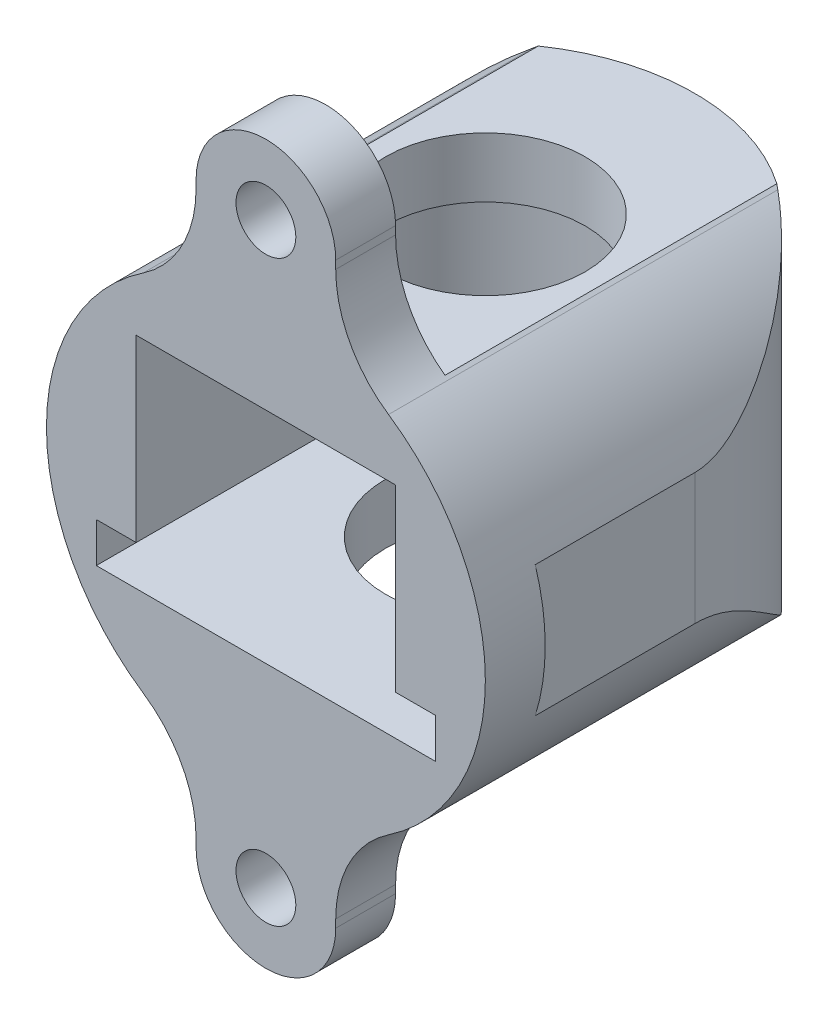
ISO-10303-21;
HEADER;
FILE_DESCRIPTION(('STEP AP214'),'2;1');
FILE_NAME('part.step','',(''),(''),'','','');
FILE_SCHEMA(('AUTOMOTIVE_DESIGN { 1 0 10303 214 1 1 1 1 }'));
ENDSEC;
DATA;
#1=APPLICATION_CONTEXT('core data for automotive mechanical design processes');
#2=APPLICATION_PROTOCOL_DEFINITION('international standard','automotive_design',2000,#1);
#3=PRODUCT_CONTEXT('',#1,'mechanical');
#4=PRODUCT('Part','Part','',(#3));
#5=PRODUCT_RELATED_PRODUCT_CATEGORY('part','',(#4));
#6=PRODUCT_DEFINITION_FORMATION('','',#4);
#7=PRODUCT_DEFINITION_CONTEXT('part definition',#1,'design');
#8=PRODUCT_DEFINITION('design','',#6,#7);
#9=PRODUCT_DEFINITION_SHAPE('','',#8);
#10=(LENGTH_UNIT() NAMED_UNIT(*) SI_UNIT(.MILLI.,.METRE.));
#11=(NAMED_UNIT(*) PLANE_ANGLE_UNIT() SI_UNIT($,.RADIAN.));
#12=(NAMED_UNIT(*) SI_UNIT($,.STERADIAN.) SOLID_ANGLE_UNIT());
#13=UNCERTAINTY_MEASURE_WITH_UNIT(LENGTH_MEASURE(1.E-05),#10,'distance_accuracy_value','');
#14=(GEOMETRIC_REPRESENTATION_CONTEXT(3) GLOBAL_UNCERTAINTY_ASSIGNED_CONTEXT((#13)) GLOBAL_UNIT_ASSIGNED_CONTEXT((#10,
#11,#12)) REPRESENTATION_CONTEXT('',''));
#15=CARTESIAN_POINT('',(0.,0.,0.));
#16=DIRECTION('',(0.,0.,1.));
#17=DIRECTION('',(1.,0.,0.));
#18=AXIS2_PLACEMENT_3D('',#15,#16,#17);
#19=CARTESIAN_POINT('',(3.49148133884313E-12,-1000.,0.));
#20=DIRECTION('',(0.,-1.,0.));
#21=DIRECTION('',(1.,0.,0.));
#22=AXIS2_PLACEMENT_3D('',#19,#20,#21);
#23=CYLINDRICAL_SURFACE('',#22,10.5);
#24=CARTESIAN_POINT('',(-6.14705882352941,13.8821525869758,-8.51255941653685));
#25=CARTESIAN_POINT('',(-6.3067962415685,13.7745062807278,-8.39720099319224));
#26=CARTESIAN_POINT('',(-6.46190974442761,13.6638857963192,-8.27836022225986));
#27=CARTESIAN_POINT('',(-6.76294510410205,13.4374456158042,-8.03431013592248));
#28=CARTESIAN_POINT('',(-6.90887042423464,13.3216279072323,-7.90910325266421));
#29=CARTESIAN_POINT('',(-7.33262527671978,12.9677925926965,-7.52514400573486));
#30=CARTESIAN_POINT('',(-7.59699669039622,12.7230077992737,-7.25764191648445));
#31=CARTESIAN_POINT('',(-8.09182206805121,12.2197341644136,-6.70161917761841));
#32=CARTESIAN_POINT('',(-8.32210069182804,11.9611831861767,-6.41300055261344));
#33=CARTESIAN_POINT('',(-8.74853776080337,11.4366157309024,-5.81783354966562));
#34=CARTESIAN_POINT('',(-8.94469206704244,11.1705983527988,-5.51128300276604));
#35=CARTESIAN_POINT('',(-9.25061013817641,10.7162935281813,-4.97406813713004));
#36=CARTESIAN_POINT('',(-9.36874892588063,10.5283330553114,-4.74783683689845));
#37=CARTESIAN_POINT('',(-9.58889404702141,10.1544521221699,-4.28586522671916));
#38=CARTESIAN_POINT('',(-9.69089619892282,9.9685322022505,-4.05012247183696));
#39=CARTESIAN_POINT('',(-9.8784391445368,9.60338874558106,-3.5683494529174));
#40=CARTESIAN_POINT('',(-9.96402778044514,9.4241470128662,-3.32235171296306));
#41=CARTESIAN_POINT('',(-10.1186105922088,9.0784827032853,-2.81667392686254));
#42=CARTESIAN_POINT('',(-10.1876253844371,8.91204437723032,-2.55701137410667));
#43=CARTESIAN_POINT('',(-10.293264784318,8.64130289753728,-2.08384796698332));
#44=CARTESIAN_POINT('',(-10.3336870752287,8.53169005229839,-1.8742947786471));
#45=CARTESIAN_POINT('',(-10.4027447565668,8.33680605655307,-1.44238968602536));
#46=CARTESIAN_POINT('',(-10.4314115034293,8.25147033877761,-1.22007365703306));
#47=CARTESIAN_POINT('',(-10.4701163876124,8.13338928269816,-0.811830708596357));
#48=CARTESIAN_POINT('',(-10.4828368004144,8.09327599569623,-0.628377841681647));
#49=CARTESIAN_POINT('',(-10.498489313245,8.04366848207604,-0.257034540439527));
#50=CARTESIAN_POINT('',(-10.5014389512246,8.03411939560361,-0.0691526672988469));
#51=CARTESIAN_POINT('',(-10.4972329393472,8.04757084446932,0.305328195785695));
#52=CARTESIAN_POINT('',(-10.4900727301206,8.0705860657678,0.491926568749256));
#53=CARTESIAN_POINT('',(-10.466430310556,8.14455992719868,0.858992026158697));
#54=CARTESIAN_POINT('',(-10.4499276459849,8.19557987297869,1.03944473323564));
#55=CARTESIAN_POINT('',(-10.4111123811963,8.31134110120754,1.37248008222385));
#56=CARTESIAN_POINT('',(-10.3896435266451,8.3739425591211,1.52593868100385));
#57=CARTESIAN_POINT('',(-10.341008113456,8.51084410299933,1.82668456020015));
#58=CARTESIAN_POINT('',(-10.3138362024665,8.58515516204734,1.97396588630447));
#59=CARTESIAN_POINT('',(-10.2541825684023,8.74231587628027,2.26355747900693));
#60=CARTESIAN_POINT('',(-10.221678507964,8.82520088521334,2.40584363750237));
#61=CARTESIAN_POINT('',(-10.1517531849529,8.9968037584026,2.68564740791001));
#62=CARTESIAN_POINT('',(-10.1143299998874,9.08552389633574,2.82316312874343));
#63=CARTESIAN_POINT('',(-10.0275894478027,9.28339676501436,3.11853141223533));
#64=CARTESIAN_POINT('',(-9.97734442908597,9.39334711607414,3.2755746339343));
#65=CARTESIAN_POINT('',(-9.87046813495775,9.61687608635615,3.58477057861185));
#66=CARTESIAN_POINT('',(-9.81383734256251,9.7304544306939,3.73692367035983));
#67=CARTESIAN_POINT('',(-9.63435139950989,10.0747074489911,4.18736314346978));
#68=CARTESIAN_POINT('',(-9.50198111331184,10.3087166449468,4.47936608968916));
#69=CARTESIAN_POINT('',(-9.21213931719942,10.7776871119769,5.04857689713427));
#70=CARTESIAN_POINT('',(-9.05471877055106,11.0126455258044,5.32581330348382));
#71=CARTESIAN_POINT('',(-8.71404353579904,11.4792890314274,5.86664336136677));
#72=CARTESIAN_POINT('',(-8.53080213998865,11.7109757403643,6.13024393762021));
#73=CARTESIAN_POINT('',(-8.18415087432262,12.1134077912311,6.58259234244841));
#74=CARTESIAN_POINT('',(-8.02628984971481,12.2856143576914,6.77430660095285));
#75=CARTESIAN_POINT('',(-7.6946818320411,12.6243515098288,7.1487336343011));
#76=CARTESIAN_POINT('',(-7.52093873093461,12.7908834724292,7.33144859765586));
#77=CARTESIAN_POINT('',(-7.15694605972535,13.1169076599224,7.68719642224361));
#78=CARTESIAN_POINT('',(-6.96667491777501,13.2763902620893,7.86021613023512));
#79=CARTESIAN_POINT('',(-6.5694298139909,13.5864430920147,8.19512156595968));
#80=CARTESIAN_POINT('',(-6.36244188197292,13.7370056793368,8.35699776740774));
#81=CARTESIAN_POINT('',(-6.14705882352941,13.8821525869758,8.51255941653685));
#82=B_SPLINE_CURVE_WITH_KNOTS('',3,(#24,#25,#26,#27,#28,#29,#30,#31,#32,#33,#34,#35,#36,#37,#38,
#39,#40,#41,#42,#43,#44,#45,#46,#47,#48,#49,#50,#51,#52,#53,#54,#55,#56,#57,#58,#59,#60,#61,#62,
#63,#64,#65,#66,#67,#68,#69,#70,#71,#72,#73,#74,#75,#76,#77,#78,#79,#80,#81),.UNSPECIFIED.,.F.,
.F.,(4,2,2,2,2,2,2,2,2,2,2,2,2,2,2,2,2,2,2,2,2,2,2,2,2,2,2,2,4),(0.,0.673353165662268,
1.34645098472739,2.69026975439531,4.04077613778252,5.39144621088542,6.34185012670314,
7.29249992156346,8.24033517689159,9.18698523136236,9.90559842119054,10.6222821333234,
11.1846231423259,11.7459542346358,12.3075385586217,12.8703571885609,13.3709697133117,
13.8720541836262,14.3752940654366,14.8787312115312,15.4730360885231,16.0672960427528,
17.2568048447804,18.4439238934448,19.6304340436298,20.5365139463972,21.4423724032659,
22.3494314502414,23.2572565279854),.UNSPECIFIED.);
#83=CARTESIAN_POINT('',(-6.14705882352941,13.8821525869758,-8.51255941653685));
#84=VERTEX_POINT('',#83);
#85=CARTESIAN_POINT('',(-10.5000000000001,8.03871926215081,0.));
#86=VERTEX_POINT('',#85);
#87=EDGE_CURVE('E531',#84,#86,#82,.T.);
#88=ORIENTED_EDGE('',*,*,#87,.F.);
#89=CARTESIAN_POINT('',(-3.5,18.8578721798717,-9.89949493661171));
#90=CARTESIAN_POINT('',(-3.50000023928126,19.0153983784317,-9.89949504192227));
#91=CARTESIAN_POINT('',(-3.50620868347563,19.1729287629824,-9.89730645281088));
#92=CARTESIAN_POINT('',(-3.5309857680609,19.4868936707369,-9.88849386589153));
#93=CARTESIAN_POINT('',(-3.54955485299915,19.6433281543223,-9.88186970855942));
#94=CARTESIAN_POINT('',(-3.59888205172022,19.9540251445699,-9.86401213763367));
#95=CARTESIAN_POINT('',(-3.62964216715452,20.1082872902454,-9.85277796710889));
#96=CARTESIAN_POINT('',(-3.70305065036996,20.4135117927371,-9.82542357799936));
#97=CARTESIAN_POINT('',(-3.74569870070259,20.5644742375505,-9.80930348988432));
#98=CARTESIAN_POINT('',(-3.84248768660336,20.8621339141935,-9.77179523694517));
#99=CARTESIAN_POINT('',(-3.89663776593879,21.008827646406,-9.7504028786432));
#100=CARTESIAN_POINT('',(-4.0158276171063,21.296750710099,-9.70192067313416));
#101=CARTESIAN_POINT('',(-4.08086739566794,21.4379800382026,-9.67483082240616));
#102=CARTESIAN_POINT('',(-4.22107396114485,21.7138972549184,-9.61448668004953));
#103=CARTESIAN_POINT('',(-4.29623794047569,21.8485869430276,-9.58123409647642));
#104=CARTESIAN_POINT('',(-4.45579444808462,22.1104866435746,-9.50808042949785));
#105=CARTESIAN_POINT('',(-4.54018680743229,22.2376967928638,-9.4681794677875));
#106=CARTESIAN_POINT('',(-4.71585575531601,22.481996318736,-9.38190483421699));
#107=CARTESIAN_POINT('',(-4.80701690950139,22.5992042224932,-9.33563166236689));
#108=CARTESIAN_POINT('',(-4.99606976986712,22.8247685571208,-9.23583816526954));
#109=CARTESIAN_POINT('',(-5.09396136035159,22.9331251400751,-9.18231796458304));
#110=CARTESIAN_POINT('',(-5.2951496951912,23.1404055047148,-9.06778810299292));
#111=CARTESIAN_POINT('',(-5.39844543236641,23.2393310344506,-9.00677983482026));
#112=CARTESIAN_POINT('',(-5.60907088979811,23.4274023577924,-8.87713988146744));
#113=CARTESIAN_POINT('',(-5.71640064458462,23.5165480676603,-8.80850813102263));
#114=CARTESIAN_POINT('',(-5.93343269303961,23.6847142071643,-8.66379518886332));
#115=CARTESIAN_POINT('',(-6.04312918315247,23.7637567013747,-8.58773089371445));
#116=CARTESIAN_POINT('',(-6.26373807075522,23.9120064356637,-8.42817397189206));
#117=CARTESIAN_POINT('',(-6.37465043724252,23.9812139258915,-8.34468153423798));
#118=CARTESIAN_POINT('',(-6.59641246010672,24.1100746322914,-8.17050927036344));
#119=CARTESIAN_POINT('',(-6.70726209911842,24.1697259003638,-8.0798279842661));
#120=CARTESIAN_POINT('',(-6.92770446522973,24.2799094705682,-7.89163678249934));
#121=CARTESIAN_POINT('',(-7.03729692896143,24.3304398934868,-7.7941254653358));
#122=CARTESIAN_POINT('',(-7.29183540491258,24.4390218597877,-7.55770125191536));
#123=CARTESIAN_POINT('',(-7.43584442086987,24.4935929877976,-7.41616890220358));
#124=CARTESIAN_POINT('',(-7.71754669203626,24.5889275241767,-7.1225634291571));
#125=CARTESIAN_POINT('',(-7.85523811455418,24.6296869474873,-6.97048727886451));
#126=CARTESIAN_POINT('',(-8.12288804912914,24.6993376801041,-6.65667252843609));
#127=CARTESIAN_POINT('',(-8.25283314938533,24.7282088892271,-6.49491808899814));
#128=CARTESIAN_POINT('',(-8.50355181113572,24.775927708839,-6.1630265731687));
#129=CARTESIAN_POINT('',(-8.62432309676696,24.7947728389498,-5.99288743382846));
#130=CARTESIAN_POINT('',(-8.89223562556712,24.8289839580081,-5.59048306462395));
#131=CARTESIAN_POINT('',(-9.035712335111,24.8413879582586,-5.35551888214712));
#132=CARTESIAN_POINT('',(-9.3038838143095,24.8561704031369,-4.87478967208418));
#133=CARTESIAN_POINT('',(-9.42857277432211,24.8585457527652,-4.62902133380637));
#134=CARTESIAN_POINT('',(-9.65830213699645,24.8568841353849,-4.12833021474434));
#135=CARTESIAN_POINT('',(-9.76333072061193,24.8528433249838,-3.87340203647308));
#136=CARTESIAN_POINT('',(-9.95298748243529,24.8415022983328,-3.35617585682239));
#137=CARTESIAN_POINT('',(-10.0376172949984,24.8342023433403,-3.09387844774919));
#138=CARTESIAN_POINT('',(-10.1872513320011,24.8188657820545,-2.55897132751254));
#139=CARTESIAN_POINT('',(-10.2518994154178,24.8108188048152,-2.28626223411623));
#140=CARTESIAN_POINT('',(-10.3591980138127,24.7962822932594,-1.7365058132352));
#141=CARTESIAN_POINT('',(-10.401848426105,24.7897927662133,-1.45945846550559));
#142=CARTESIAN_POINT('',(-10.4648420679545,24.7798735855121,-0.903003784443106));
#143=CARTESIAN_POINT('',(-10.4852030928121,24.7764414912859,-0.623598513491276));
#144=CARTESIAN_POINT('',(-10.5035359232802,24.7733603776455,-0.0640311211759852));
#145=CARTESIAN_POINT('',(-10.5015073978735,24.7737114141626,0.216131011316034));
#146=CARTESIAN_POINT('',(-10.4744550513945,24.7782305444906,0.788443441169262));
#147=CARTESIAN_POINT('',(-10.4483612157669,24.782576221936,1.08054223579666));
#148=CARTESIAN_POINT('',(-10.3718523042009,24.7943157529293,1.66148420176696));
#149=CARTESIAN_POINT('',(-10.3214357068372,24.8017097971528,1.95032716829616));
#150=CARTESIAN_POINT('',(-10.1965239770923,24.8176389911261,2.52329895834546));
#151=CARTESIAN_POINT('',(-10.1219833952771,24.8261762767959,2.80741781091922));
#152=CARTESIAN_POINT('',(-9.94935465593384,24.8416488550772,3.3684536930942));
#153=CARTESIAN_POINT('',(-9.85126691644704,24.8485841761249,3.64537085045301));
#154=CARTESIAN_POINT('',(-9.63114474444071,24.8574595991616,4.1927184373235));
#155=CARTESIAN_POINT('',(-9.50888955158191,24.8593511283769,4.46306112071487));
#156=CARTESIAN_POINT('',(-9.24193053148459,24.8538058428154,4.99245294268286));
#157=CARTESIAN_POINT('',(-9.09722218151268,24.8463671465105,5.25149979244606));
#158=CARTESIAN_POINT('',(-8.78725899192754,24.817415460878,5.7551043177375));
#159=CARTESIAN_POINT('',(-8.62207057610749,24.7959470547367,5.99970522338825));
#160=CARTESIAN_POINT('',(-8.27300738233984,24.7337425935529,6.47251755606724));
#161=CARTESIAN_POINT('',(-8.08914728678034,24.6930215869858,6.70074162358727));
#162=CARTESIAN_POINT('',(-7.78114255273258,24.6076681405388,7.05231937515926));
#163=CARTESIAN_POINT('',(-7.66176253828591,24.5707925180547,7.18178218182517));
#164=CARTESIAN_POINT('',(-7.41846638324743,24.4867063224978,7.43282337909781));
#165=CARTESIAN_POINT('',(-7.29455172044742,24.4394990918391,7.55440430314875));
#166=CARTESIAN_POINT('',(-7.0435732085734,24.3336826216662,7.78893866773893));
#167=CARTESIAN_POINT('',(-6.91651101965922,24.2750792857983,7.90189653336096));
#168=CARTESIAN_POINT('',(-6.66079595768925,24.1455424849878,8.11861329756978));
#169=CARTESIAN_POINT('',(-6.53214304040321,24.0746086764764,8.22237193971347));
#170=CARTESIAN_POINT('',(-6.27409687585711,23.9191382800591,8.42095167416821));
#171=CARTESIAN_POINT('',(-6.14470602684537,23.8344965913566,8.51569392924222));
#172=CARTESIAN_POINT('',(-5.88835912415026,23.6517041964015,8.69492323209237));
#173=CARTESIAN_POINT('',(-5.76140309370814,23.5535533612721,8.7794101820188));
#174=CARTESIAN_POINT('',(-5.51219874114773,23.3438450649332,8.93797962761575));
#175=CARTESIAN_POINT('',(-5.38994932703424,23.2322907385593,9.01206454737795));
#176=CARTESIAN_POINT('',(-5.15236249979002,22.9962387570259,9.14997447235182));
#177=CARTESIAN_POINT('',(-5.03702431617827,22.8717425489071,9.21380062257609));
#178=CARTESIAN_POINT('',(-4.82869581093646,22.6263762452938,9.32447844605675));
#179=CARTESIAN_POINT('',(-4.73468618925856,22.5068714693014,9.37244844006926));
#180=CARTESIAN_POINT('',(-4.55491343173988,22.2592717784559,9.46112102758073));
#181=CARTESIAN_POINT('',(-4.46915000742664,22.1311771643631,9.5018238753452));
#182=CARTESIAN_POINT('',(-4.30699929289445,21.8673115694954,9.57641512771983));
#183=CARTESIAN_POINT('',(-4.23061166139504,21.7315408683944,9.61030378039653));
#184=CARTESIAN_POINT('',(-4.08815425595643,21.4533202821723,9.67176388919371));
#185=CARTESIAN_POINT('',(-4.02208457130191,21.3108703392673,9.69933529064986));
#186=CARTESIAN_POINT('',(-3.90286677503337,21.0247571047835,9.74790487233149));
#187=CARTESIAN_POINT('',(-3.84938851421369,20.8812605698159,9.76907651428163));
#188=CARTESIAN_POINT('',(-3.75339889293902,20.5899524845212,9.80635767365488));
#189=CARTESIAN_POINT('',(-3.7108911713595,20.4421395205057,9.82246551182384));
#190=CARTESIAN_POINT('',(-3.63729032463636,20.1432956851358,9.84995754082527));
#191=CARTESIAN_POINT('',(-3.6061953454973,19.9922653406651,9.86134249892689));
#192=CARTESIAN_POINT('',(-3.55570135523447,19.6879917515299,9.87966141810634));
#193=CARTESIAN_POINT('',(-3.53630278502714,19.5347484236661,9.88659521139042));
#194=CARTESIAN_POINT('',(-3.50910123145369,19.2238981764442,9.8962833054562));
#195=CARTESIAN_POINT('',(-3.50154694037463,19.0662666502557,9.89894799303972));
#196=CARTESIAN_POINT('',(-3.49888154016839,18.7508845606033,9.89989038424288));
#197=CARTESIAN_POINT('',(-3.50377056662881,18.5931339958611,9.89816804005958));
#198=CARTESIAN_POINT('',(-3.52594770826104,18.2785988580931,9.89028973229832));
#199=CARTESIAN_POINT('',(-3.54323726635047,18.1218143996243,9.88413325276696));
#200=CARTESIAN_POINT('',(-3.59005306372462,17.8103376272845,9.86722541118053));
#201=CARTESIAN_POINT('',(-3.61957897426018,17.6556452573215,9.85647417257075));
#202=CARTESIAN_POINT('',(-3.69084801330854,17.3482945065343,9.83000995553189));
#203=CARTESIAN_POINT('',(-3.73268144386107,17.1956602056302,9.81426023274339));
#204=CARTESIAN_POINT('',(-3.82802918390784,16.8948036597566,9.77746390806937));
#205=CARTESIAN_POINT('',(-3.88153900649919,16.7465797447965,9.75641934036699));
#206=CARTESIAN_POINT('',(-3.99966780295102,16.4555808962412,9.70858975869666));
#207=CARTESIAN_POINT('',(-4.0642868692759,16.3128060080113,9.68180469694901));
#208=CARTESIAN_POINT('',(-4.20388767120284,16.0337743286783,9.62201072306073));
#209=CARTESIAN_POINT('',(-4.27886919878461,15.8975174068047,9.58900193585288));
#210=CARTESIAN_POINT('',(-4.43704951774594,15.6345647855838,9.51682866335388));
#211=CARTESIAN_POINT('',(-4.52010424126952,15.5077542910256,9.47776662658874));
#212=CARTESIAN_POINT('',(-4.69432515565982,15.2623001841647,9.39269417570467));
#213=CARTESIAN_POINT('',(-4.78549121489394,15.1436564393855,9.34668387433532));
#214=CARTESIAN_POINT('',(-4.97471249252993,14.9153154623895,9.24735881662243));
#215=CARTESIAN_POINT('',(-5.07276581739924,14.8056157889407,9.1940460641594));
#216=CARTESIAN_POINT('',(-5.27445915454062,14.5957143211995,9.079840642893));
#217=CARTESIAN_POINT('',(-5.37809912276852,14.4955124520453,9.01894803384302));
#218=CARTESIAN_POINT('',(-5.58807478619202,14.3063302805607,8.89035214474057));
#219=CARTESIAN_POINT('',(-5.69435254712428,14.2172126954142,8.82275596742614));
#220=CARTESIAN_POINT('',(-5.90957962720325,14.0487602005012,8.68006546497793));
#221=CARTESIAN_POINT('',(-6.01852890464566,13.9694251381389,8.60497125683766));
#222=CARTESIAN_POINT('',(-6.23774086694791,13.8204891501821,8.44741424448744));
#223=CARTESIAN_POINT('',(-6.34800360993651,13.7508886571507,8.36495111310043));
#224=CARTESIAN_POINT('',(-6.56855758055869,13.6211729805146,8.19290040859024));
#225=CARTESIAN_POINT('',(-6.67884881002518,13.561058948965,8.10331197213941));
#226=CARTESIAN_POINT('',(-6.90497916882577,13.4465045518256,7.91167145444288));
#227=CARTESIAN_POINT('',(-7.02074530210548,13.3926356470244,7.80919225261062));
#228=CARTESIAN_POINT('',(-7.24972909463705,13.2944375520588,7.59709089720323));
#229=CARTESIAN_POINT('',(-7.36294670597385,13.2501085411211,7.48746860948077));
#230=CARTESIAN_POINT('',(-7.58584798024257,13.1701617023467,7.26154957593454));
#231=CARTESIAN_POINT('',(-7.69552978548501,13.1345483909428,7.14524940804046));
#232=CARTESIAN_POINT('',(-7.91045403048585,13.0711718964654,6.9065572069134));
#233=CARTESIAN_POINT('',(-8.01569559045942,13.0434102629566,6.78416397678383));
#234=CARTESIAN_POINT('',(-8.27514056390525,12.982016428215,6.46785046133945));
#235=CARTESIAN_POINT('',(-8.42593275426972,12.9529951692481,6.2702141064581));
#236=CARTESIAN_POINT('',(-8.71372061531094,12.9078299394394,5.86371693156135));
#237=CARTESIAN_POINT('',(-8.85071023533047,12.8916915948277,5.65485124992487));
#238=CARTESIAN_POINT('',(-9.10985960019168,12.8691548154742,5.22714908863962));
#239=CARTESIAN_POINT('',(-9.2319933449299,12.862773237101,5.00829602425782));
#240=CARTESIAN_POINT('',(-9.4603045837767,12.8569167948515,4.5623882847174));
#241=CARTESIAN_POINT('',(-9.56648358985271,12.8574412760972,4.33533438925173));
#242=CARTESIAN_POINT('',(-9.76464763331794,12.8628723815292,3.8687744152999));
#243=CARTESIAN_POINT('',(-9.85623421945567,12.8678831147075,3.62910054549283));
#244=CARTESIAN_POINT('',(-10.0216064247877,12.8800128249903,3.1437460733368));
#245=CARTESIAN_POINT('',(-10.095391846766,12.8871318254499,2.89806540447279));
#246=CARTESIAN_POINT('',(-10.2247391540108,12.9014479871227,2.40214932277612));
#247=CARTESIAN_POINT('',(-10.2803146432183,12.9086450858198,2.15191745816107));
#248=CARTESIAN_POINT('',(-10.3730272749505,12.9215424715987,1.64801249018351));
#249=CARTESIAN_POINT('',(-10.4101632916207,12.9272426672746,1.39433917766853));
#250=CARTESIAN_POINT('',(-10.469939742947,12.9366984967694,0.846811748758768));
#251=CARTESIAN_POINT('',(-10.4895847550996,12.9400362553,0.552617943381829));
#252=CARTESIAN_POINT('',(-10.5040699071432,12.942477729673,-0.0364165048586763));
#253=CARTESIAN_POINT('',(-10.4989076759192,12.9415810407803,-0.331257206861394));
#254=CARTESIAN_POINT('',(-10.4637989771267,12.9357604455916,-0.91971436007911));
#255=CARTESIAN_POINT('',(-10.4338277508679,12.9308325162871,-1.21332929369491));
#256=CARTESIAN_POINT('',(-10.3492997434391,12.9181323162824,-1.79692178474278));
#257=CARTESIAN_POINT('',(-10.2947436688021,12.9103601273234,-2.08689944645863));
#258=CARTESIAN_POINT('',(-10.1619145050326,12.8941228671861,-2.65916636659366));
#259=CARTESIAN_POINT('',(-10.0838132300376,12.8856631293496,-2.94149569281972));
#260=CARTESIAN_POINT('',(-9.90426856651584,12.8708298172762,-3.49873614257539));
#261=CARTESIAN_POINT('',(-9.80282244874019,12.8644564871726,-3.7736463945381));
#262=CARTESIAN_POINT('',(-9.57736830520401,12.8573120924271,-4.3138876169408));
#263=CARTESIAN_POINT('',(-9.453378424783,12.8565365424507,-4.57922608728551));
#264=CARTESIAN_POINT('',(-9.1837391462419,12.8646958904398,-5.09847243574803));
#265=CARTESIAN_POINT('',(-9.03809787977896,12.8736271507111,-5.35238455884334));
#266=CARTESIAN_POINT('',(-8.77030170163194,12.901345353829,-5.77719686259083));
#267=CARTESIAN_POINT('',(-8.65301516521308,12.9166657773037,-5.95140687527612));
#268=CARTESIAN_POINT('',(-8.40876884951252,12.9566413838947,-6.29177597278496));
#269=CARTESIAN_POINT('',(-8.28181144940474,12.9812942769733,-6.45793702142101));
#270=CARTESIAN_POINT('',(-8.01947505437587,13.0418479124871,-6.78094731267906));
#271=CARTESIAN_POINT('',(-7.88410855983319,13.0777322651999,-6.93780973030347));
#272=CARTESIAN_POINT('',(-7.60626280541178,13.1627122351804,-7.24134380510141));
#273=CARTESIAN_POINT('',(-7.46378496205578,13.2118052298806,-7.38801747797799));
#274=CARTESIAN_POINT('',(-7.20110095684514,13.3143166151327,-7.64336870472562));
#275=CARTESIAN_POINT('',(-7.08177545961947,13.365163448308,-7.75398788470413));
#276=CARTESIAN_POINT('',(-6.84103187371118,13.4775815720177,-7.96719005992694));
#277=CARTESIAN_POINT('',(-6.71961425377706,13.5391504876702,-8.06977482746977));
#278=CARTESIAN_POINT('',(-6.47619815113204,13.6736701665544,-8.266397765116));
#279=CARTESIAN_POINT('',(-6.35419981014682,13.7466182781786,-8.36043791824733));
#280=CARTESIAN_POINT('',(-6.11128252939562,13.904332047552,-8.53961385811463));
#281=CARTESIAN_POINT('',(-5.99036360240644,13.9890978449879,-8.62474953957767));
#282=CARTESIAN_POINT('',(-5.75078729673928,14.1710664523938,-8.78632096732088));
#283=CARTESIAN_POINT('',(-5.63214547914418,14.268333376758,-8.8627077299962));
#284=CARTESIAN_POINT('',(-5.39969208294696,14.4747643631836,-9.0062194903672));
#285=CARTESIAN_POINT('',(-5.28588058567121,14.5839286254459,-9.07334433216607));
#286=CARTESIAN_POINT('',(-5.06494422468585,14.8136567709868,-9.19850356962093));
#287=CARTESIAN_POINT('',(-4.95781966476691,14.9342211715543,-9.2565375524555));
#288=CARTESIAN_POINT('',(-4.75200087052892,15.1859609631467,-9.36386483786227));
#289=CARTESIAN_POINT('',(-4.65330604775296,15.3171356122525,-9.41315875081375));
#290=CARTESIAN_POINT('',(-4.47439517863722,15.5767366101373,-9.49940739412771));
#291=CARTESIAN_POINT('',(-4.3933150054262,15.7043326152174,-9.53707585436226));
#292=CARTESIAN_POINT('',(-4.24038997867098,15.9665852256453,-9.60604662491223));
#293=CARTESIAN_POINT('',(-4.1685450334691,16.1012417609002,-9.6373489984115));
#294=CARTESIAN_POINT('',(-4.03494094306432,16.3766323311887,-9.69404561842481));
#295=CARTESIAN_POINT('',(-3.97318023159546,16.5173654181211,-9.71944078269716));
#296=CARTESIAN_POINT('',(-3.86040783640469,16.8039228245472,-9.76478098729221));
#297=CARTESIAN_POINT('',(-3.80939609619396,16.9497471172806,-9.78472605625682));
#298=CARTESIAN_POINT('',(-3.72054189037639,17.2392822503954,-9.81884601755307));
#299=CARTESIAN_POINT('',(-3.68223927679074,17.3828279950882,-9.83322670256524));
#300=CARTESIAN_POINT('',(-3.6163228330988,17.6727751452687,-9.85765928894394));
#301=CARTESIAN_POINT('',(-3.58871323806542,17.8191776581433,-9.86770947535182));
#302=CARTESIAN_POINT('',(-3.54444888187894,18.1138275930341,-9.88369549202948));
#303=CARTESIAN_POINT('',(-3.52779244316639,18.2620747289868,-9.88963195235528));
#304=CARTESIAN_POINT('',(-3.50556776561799,18.5595040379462,-9.89753166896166));
#305=CARTESIAN_POINT('',(-3.49999977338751,18.7086862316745,-9.89949483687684));
#306=CARTESIAN_POINT('',(-3.5,18.8578721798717,-9.89949493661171));
#307=B_SPLINE_CURVE_WITH_KNOTS('',3,(#89,#90,#91,#92,#93,#94,#95,#96,#97,#98,#99,#100,#101,#102,
#103,#104,#105,#106,#107,#108,#109,#110,#111,#112,#113,#114,#115,#116,#117,#118,#119,#120,#121,
#122,#123,#124,#125,#126,#127,#128,#129,#130,#131,#132,#133,#134,#135,#136,#137,#138,#139,#140,
#141,#142,#143,#144,#145,#146,#147,#148,#149,#150,#151,#152,#153,#154,#155,#156,#157,#158,#159,
#160,#161,#162,#163,#164,#165,#166,#167,#168,#169,#170,#171,#172,#173,#174,#175,#176,#177,#178,
#179,#180,#181,#182,#183,#184,#185,#186,#187,#188,#189,#190,#191,#192,#193,#194,#195,#196,#197,
#198,#199,#200,#201,#202,#203,#204,#205,#206,#207,#208,#209,#210,#211,#212,#213,#214,#215,#216,
#217,#218,#219,#220,#221,#222,#223,#224,#225,#226,#227,#228,#229,#230,#231,#232,#233,#234,#235,
#236,#237,#238,#239,#240,#241,#242,#243,#244,#245,#246,#247,#248,#249,#250,#251,#252,#253,#254,
#255,#256,#257,#258,#259,#260,#261,#262,#263,#264,#265,#266,#267,#268,#269,#270,#271,#272,#273,
#274,#275,#276,#277,#278,#279,#280,#281,#282,#283,#284,#285,#286,#287,#288,#289,#290,#291,#292,
#293,#294,#295,#296,#297,#298,#299,#300,#301,#302,#303,#304,#305,#306),.UNSPECIFIED.,.T.,.F.,(4,
2,2,2,2,2,2,2,2,2,2,2,2,2,2,2,2,2,2,2,2,2,2,2,2,2,2,2,2,2,2,2,2,2,2,2,2,2,2,2,2,2,2,2,2,2,2,2,2,
2,2,2,2,2,2,2,2,2,2,2,2,2,2,2,2,2,2,2,2,2,2,2,2,2,2,2,2,2,2,2,2,2,2,2,2,2,2,2,2,2,2,2,2,2,2,2,2,
2,2,2,2,2,2,2,2,2,2,2,4),(0.,0.472448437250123,0.944913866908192,1.41745690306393,
1.88998732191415,2.36289480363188,2.8358025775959,3.30857947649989,3.78134772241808,
4.24736898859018,4.71338224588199,5.17930895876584,5.64523966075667,6.11013476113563,
6.57501803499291,7.03999595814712,7.5050695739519,8.13162375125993,8.75835855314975,
9.38614870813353,10.0140941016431,10.8396848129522,11.6655302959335,12.4918706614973,
13.3181447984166,14.1583938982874,14.9986469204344,15.8382286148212,16.6778227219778,
17.5566464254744,18.4355251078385,19.3160693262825,20.1965979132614,21.0855760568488,
21.9747335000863,22.8610790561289,23.746732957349,24.2860471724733,24.8251871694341,
25.3640486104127,25.9029250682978,26.4461479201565,26.9893759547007,27.5324771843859,
28.0755177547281,28.5532342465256,29.0309340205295,29.5086164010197,29.9863029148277,
30.4495538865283,30.9129583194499,31.3762874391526,31.8396340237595,32.3125850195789,
32.7855411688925,33.2585523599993,33.7315508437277,34.2081102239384,34.6844867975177,
35.1608673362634,35.6372383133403,36.1062849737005,36.5753240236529,37.0442346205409,
37.5131415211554,37.975493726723,38.4378387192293,38.900204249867,39.3626258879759,
39.8533150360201,40.3440134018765,40.8349655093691,41.326014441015,42.0757310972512,
42.8257749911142,43.5771132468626,44.3283802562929,45.0975465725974,45.8667214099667,
46.6353203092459,47.4039661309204,48.2874744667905,49.1710672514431,50.0555429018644,
50.9399931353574,51.8181394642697,52.6963885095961,53.5739337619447,54.4511502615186,
55.0823496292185,55.7133942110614,56.3435221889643,56.9735251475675,57.4844463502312,
57.9952545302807,58.5059438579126,59.0166392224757,59.53006692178,60.0435032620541,
60.5569629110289,61.0703866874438,61.5372305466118,62.0040697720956,62.4708364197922,
62.9376006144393,63.3849168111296,63.8324099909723,64.2798346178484,64.7272691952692),.UNSPECIFIED.);
#308=CARTESIAN_POINT('',(-5.97848358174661,13.9999999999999,-8.63178626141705));
#309=VERTEX_POINT('',#308);
#310=EDGE_CURVE('E537',#84,#309,#307,.T.);
#311=ORIENTED_EDGE('',*,*,#310,.T.);
#312=CARTESIAN_POINT('',(0.,14.,0.));
#313=DIRECTION('',(0.,-1.,0.));
#314=DIRECTION('',(1.,0.,0.));
#315=AXIS2_PLACEMENT_3D('',#312,#313,#314);
#316=CIRCLE('',#315,10.5);
#317=CARTESIAN_POINT('',(5.97848358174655,14.,-8.63178626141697));
#318=VERTEX_POINT('',#317);
#319=EDGE_CURVE('E46',#309,#318,#316,.T.);
#320=ORIENTED_EDGE('',*,*,#319,.T.);
#321=CARTESIAN_POINT('',(5.97848358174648,14.,-8.63178626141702));
#322=CARTESIAN_POINT('',(6.04467141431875,13.9520180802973,-8.58594594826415));
#323=CARTESIAN_POINT('',(6.11120354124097,13.9058539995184,-8.53873576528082));
#324=CARTESIAN_POINT('',(6.2446708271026,13.817113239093,-8.44161666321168));
#325=CARTESIAN_POINT('',(6.31160592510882,13.7745360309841,-8.3917081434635));
#326=CARTESIAN_POINT('',(6.51239279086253,13.6522284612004,-8.2381471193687));
#327=CARTESIAN_POINT('',(6.64644940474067,13.577762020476,-8.13050555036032));
#328=CARTESIAN_POINT('',(6.91136221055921,13.4430027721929,-7.90650625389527));
#329=CARTESIAN_POINT('',(7.04223744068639,13.3825599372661,-7.79026020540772));
#330=CARTESIAN_POINT('',(7.30062466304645,13.2737510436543,-7.54865457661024));
#331=CARTESIAN_POINT('',(7.42813524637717,13.2253899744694,-7.42329125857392));
#332=CARTESIAN_POINT('',(7.70586750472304,13.1301203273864,-7.13567594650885));
#333=CARTESIAN_POINT('',(7.85489623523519,13.0858841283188,-6.97138582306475));
#334=CARTESIAN_POINT('',(8.14360691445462,13.0112967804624,-6.6318452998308));
#335=CARTESIAN_POINT('',(8.28328733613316,12.9809478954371,-6.45659311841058));
#336=CARTESIAN_POINT('',(8.5523964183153,12.9315877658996,-6.09568769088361));
#337=CARTESIAN_POINT('',(8.68177734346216,12.9126269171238,-5.90999213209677));
#338=CARTESIAN_POINT('',(8.92856249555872,12.8838538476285,-5.53010973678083));
#339=CARTESIAN_POINT('',(9.04596371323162,12.874043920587,-5.33592078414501));
#340=CARTESIAN_POINT('',(9.29791393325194,12.8596134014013,-4.88689047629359));
#341=CARTESIAN_POINT('',(9.4285729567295,12.8571002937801,-4.62979244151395));
#342=CARTESIAN_POINT('',(9.66831125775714,12.8590351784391,-4.10571059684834));
#343=CARTESIAN_POINT('',(9.77738368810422,12.863485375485,-3.83872368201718));
#344=CARTESIAN_POINT('',(9.97308090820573,12.8757485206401,-3.29704175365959));
#345=CARTESIAN_POINT('',(10.0597292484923,12.8835579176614,-3.02235516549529));
#346=CARTESIAN_POINT('',(10.2101422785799,12.8995661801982,-2.46693515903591));
#347=CARTESIAN_POINT('',(10.2739158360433,12.9077648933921,-2.18620412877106));
#348=CARTESIAN_POINT('',(10.3839192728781,12.9230467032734,-1.5893524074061));
#349=CARTESIAN_POINT('',(10.4274643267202,12.9299094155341,-1.27272186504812));
#350=CARTESIAN_POINT('',(10.4709872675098,12.9369461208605,-0.79614608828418));
#351=CARTESIAN_POINT('',(10.4818624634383,12.9387486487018,-0.637146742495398));
#352=CARTESIAN_POINT('',(10.4963695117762,12.9411772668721,-0.31877333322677));
#353=CARTESIAN_POINT('',(10.499999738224,12.9418030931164,-0.159399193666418));
#354=CARTESIAN_POINT('',(10.5,12.9417923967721,0.));
#355=B_SPLINE_CURVE_WITH_KNOTS('',3,(#321,#322,#323,#324,#325,#326,#327,#328,#329,#330,#331,
#332,#333,#334,#335,#336,#337,#338,#339,#340,#341,#342,#343,#344,#345,#346,#347,#348,#349,#350,
#351,#352,#353,#354),.UNSPECIFIED.,.F.,.F.,(4,2,2,2,2,2,2,2,2,2,2,2,2,2,2,2,4),(0.,
0.281115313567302,0.562189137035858,1.12339632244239,1.67828998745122,2.2334124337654,
2.91095831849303,3.58861461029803,4.26924806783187,4.95005208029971,5.81410275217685,
6.67842706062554,7.5418399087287,8.40491768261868,9.36247869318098,9.8404767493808,
10.3185820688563),.UNSPECIFIED.);
#356=CARTESIAN_POINT('',(6.14705882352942,13.8821525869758,-8.51255941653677));
#357=VERTEX_POINT('',#356);
#358=EDGE_CURVE('E512',#318,#357,#355,.T.);
#359=ORIENTED_EDGE('',*,*,#358,.T.);
#360=CARTESIAN_POINT('',(10.5,8.0387192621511,0.));
#361=CARTESIAN_POINT('',(10.5000180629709,8.03861344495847,-0.105854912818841));
#362=CARTESIAN_POINT('',(10.4984000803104,8.04384340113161,-0.211637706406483));
#363=CARTESIAN_POINT('',(10.4920416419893,8.06412714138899,-0.4218896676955));
#364=CARTESIAN_POINT('',(10.4873095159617,8.07915471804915,-0.526361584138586));
#365=CARTESIAN_POINT('',(10.4749932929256,8.11781033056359,-0.731360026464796));
#366=CARTESIAN_POINT('',(10.4674671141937,8.14126341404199,-0.831923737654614));
#367=CARTESIAN_POINT('',(10.4497547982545,8.19561471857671,-1.03082355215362));
#368=CARTESIAN_POINT('',(10.4395667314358,8.22651833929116,-1.12915798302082));
#369=CARTESIAN_POINT('',(10.4095303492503,8.31599139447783,-1.38459665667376));
#370=CARTESIAN_POINT('',(10.3876419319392,8.37971680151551,-1.53965166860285));
#371=CARTESIAN_POINT('',(10.3380699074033,8.51895982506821,-1.84337490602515));
#372=CARTESIAN_POINT('',(10.3103820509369,8.59448607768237,-1.99203835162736));
#373=CARTESIAN_POINT('',(10.2493421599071,8.75480134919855,-2.28554785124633));
#374=CARTESIAN_POINT('',(10.215922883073,8.83969548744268,-2.43032179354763));
#375=CARTESIAN_POINT('',(10.1440132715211,9.0153509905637,-2.71487011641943));
#376=CARTESIAN_POINT('',(10.1055241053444,9.10611100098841,-2.85464563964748));
#377=CARTESIAN_POINT('',(10.0165641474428,9.30781221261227,-3.15386400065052));
#378=CARTESIAN_POINT('',(9.9651731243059,9.41952301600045,-3.31251218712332));
#379=CARTESIAN_POINT('',(9.85583291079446,9.64656098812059,-3.62490229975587));
#380=CARTESIAN_POINT('',(9.79788221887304,9.76188898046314,-3.77864309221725));
#381=CARTESIAN_POINT('',(9.61421032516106,10.1112659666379,-4.23370082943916));
#382=CARTESIAN_POINT('',(9.47873169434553,10.3485629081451,-4.52864592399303));
#383=CARTESIAN_POINT('',(9.18245579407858,10.8230499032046,-5.10255784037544));
#384=CARTESIAN_POINT('',(9.02179196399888,11.060234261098,-5.38159886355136));
#385=CARTESIAN_POINT('',(8.67406628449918,11.530978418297,-5.92577045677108));
#386=CARTESIAN_POINT('',(8.48701727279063,11.7645399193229,-6.19090770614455));
#387=CARTESIAN_POINT('',(8.12846402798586,12.1752377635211,-6.65162530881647));
#388=CARTESIAN_POINT('',(7.96214306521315,12.3537907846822,-6.84998679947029));
#389=CARTESIAN_POINT('',(7.61224913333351,12.7044944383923,-7.23682645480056));
#390=CARTESIAN_POINT('',(7.42868098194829,12.8766468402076,-7.42530735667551));
#391=CARTESIAN_POINT('',(7.04305601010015,13.2134717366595,-7.79207841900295));
#392=CARTESIAN_POINT('',(6.84092424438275,13.3781094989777,-7.97032208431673));
#393=CARTESIAN_POINT('',(6.4184070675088,13.6972353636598,-8.31433735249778));
#394=CARTESIAN_POINT('',(6.19800372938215,13.8517132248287,-8.48009639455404));
#395=CARTESIAN_POINT('',(5.96845038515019,14.,-8.63872675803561));
#396=B_SPLINE_CURVE_WITH_KNOTS('',3,(#360,#361,#362,#363,#364,#365,#366,#367,#368,#369,#370,
#371,#372,#373,#374,#375,#376,#377,#378,#379,#380,#381,#382,#383,#384,#385,#386,#387,#388,#389,
#390,#391,#392,#393,#394,#395),.UNSPECIFIED.,.F.,.F.,(4,2,2,2,2,2,2,2,2,2,2,2,2,2,2,2,2,4),(0.,
0.317308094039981,0.633770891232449,0.944009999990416,1.25447462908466,1.76074757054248,
2.26739276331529,2.78044917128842,3.29338753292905,3.89530953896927,4.49736960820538,
5.70226894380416,6.90098762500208,8.0991250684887,9.04190832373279,9.98442900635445,
10.930937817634,11.8783865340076),.UNSPECIFIED.);
#397=CARTESIAN_POINT('',(10.5,8.03871926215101,0.));
#398=VERTEX_POINT('',#397);
#399=EDGE_CURVE('E251',#398,#357,#396,.T.);
#400=ORIENTED_EDGE('',*,*,#399,.F.);
#401=DIRECTION('',(0.,-1.,0.));
#402=VECTOR('',#401,1.);
#403=CARTESIAN_POINT('',(10.5,0.,0.));
#404=LINE('',#403,#402);
#405=CARTESIAN_POINT('',(10.5,1.48128073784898,0.));
#406=VERTEX_POINT('',#405);
#407=EDGE_CURVE('E243',#398,#406,#404,.T.);
#408=ORIENTED_EDGE('',*,*,#407,.T.);
#409=CARTESIAN_POINT('',(10.5,1.48128073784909,0.));
#410=CARTESIAN_POINT('',(10.499999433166,1.48127782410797,0.104353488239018));
#411=CARTESIAN_POINT('',(10.4984379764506,1.47626489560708,0.208728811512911));
#412=CARTESIAN_POINT('',(10.4922527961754,1.45655809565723,0.416491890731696));
#413=CARTESIAN_POINT('',(10.4876271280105,1.44185807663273,0.519878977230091));
#414=CARTESIAN_POINT('',(10.469332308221,1.3843921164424,0.827854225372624));
#415=CARTESIAN_POINT('',(10.4512464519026,1.3282670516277,1.02974456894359));
#416=CARTESIAN_POINT('',(10.4094436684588,1.20375560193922,1.38540302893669));
#417=CARTESIAN_POINT('',(10.3874514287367,1.13973004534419,1.54102181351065));
#418=CARTESIAN_POINT('',(10.3376147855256,0.99978010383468,1.84595771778));
#419=CARTESIAN_POINT('',(10.3097651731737,0.923845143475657,1.99526908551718));
#420=CARTESIAN_POINT('',(10.2486376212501,0.76339833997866,2.28866309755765));
#421=CARTESIAN_POINT('',(10.2153411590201,0.67885761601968,2.43272577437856));
#422=CARTESIAN_POINT('',(10.1437028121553,0.503916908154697,2.7159952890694));
#423=CARTESIAN_POINT('',(10.1053590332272,0.413514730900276,2.85520027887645));
#424=CARTESIAN_POINT('',(10.0166742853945,0.212437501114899,3.1534942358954));
#425=CARTESIAN_POINT('',(9.96540884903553,0.100989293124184,3.31178447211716));
#426=CARTESIAN_POINT('',(9.85636607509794,-0.125476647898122,3.62343281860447));
#427=CARTESIAN_POINT('',(9.79858922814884,-0.240494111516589,3.77679129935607));
#428=CARTESIAN_POINT('',(9.61546826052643,-0.588971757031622,4.23078299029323));
#429=CARTESIAN_POINT('',(9.48041279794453,-0.825673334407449,4.52506978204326));
#430=CARTESIAN_POINT('',(9.18438564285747,-1.3001542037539,5.09913404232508));
#431=CARTESIAN_POINT('',(9.02342054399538,-1.5379332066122,5.37891517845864));
#432=CARTESIAN_POINT('',(8.67497487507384,-2.00984394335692,5.92448252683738));
#433=CARTESIAN_POINT('',(8.48750829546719,-2.24397752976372,6.19027602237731));
#434=CARTESIAN_POINT('',(8.11165436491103,-2.67449202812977,6.6732252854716));
#435=CARTESIAN_POINT('',(7.92662876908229,-2.87178921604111,6.89218118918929));
#436=CARTESIAN_POINT('',(7.5353145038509,-3.25839641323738,7.31796695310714));
#437=CARTESIAN_POINT('',(7.32902328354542,-3.4477054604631,7.52479535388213));
#438=CARTESIAN_POINT('',(6.89513183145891,-3.81542331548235,7.92426324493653));
#439=CARTESIAN_POINT('',(6.66757320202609,-3.99385232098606,8.11692917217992));
#440=CARTESIAN_POINT('',(6.19046401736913,-4.33750277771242,8.48641021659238));
#441=CARTESIAN_POINT('',(5.94091170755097,-4.50272317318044,8.6632240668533));
#442=CARTESIAN_POINT('',(5.4862563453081,-4.77689914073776,8.95568691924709));
#443=CARTESIAN_POINT('',(5.28598007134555,-4.88948097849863,9.0754586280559));
#444=CARTESIAN_POINT('',(4.87359762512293,-5.10418041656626,9.30341459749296));
#445=CARTESIAN_POINT('',(4.66149444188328,-5.2063006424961,9.41160176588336));
#446=CARTESIAN_POINT('',(4.22598627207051,-5.3986263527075,9.61502921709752));
#447=CARTESIAN_POINT('',(4.0025829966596,-5.48883363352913,9.71027145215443));
#448=CARTESIAN_POINT('',(3.54530562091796,-5.65585551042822,9.88639605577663));
#449=CARTESIAN_POINT('',(3.31143135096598,-5.73266988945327,9.96727819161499));
#450=CARTESIAN_POINT('',(2.83215871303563,-5.87210955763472,10.1139644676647));
#451=CARTESIAN_POINT('',(2.58667028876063,-5.93458936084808,10.179614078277));
#452=CARTESIAN_POINT('',(2.08807278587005,-6.04300997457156,10.2934603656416));
#453=CARTESIAN_POINT('',(1.8349636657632,-6.08895069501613,10.3416569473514));
#454=CARTESIAN_POINT('',(1.32356407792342,-6.16313470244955,10.4194533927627));
#455=CARTESIAN_POINT('',(1.06527843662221,-6.1913937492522,10.4490698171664));
#456=CARTESIAN_POINT('',(0.545886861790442,-6.22953026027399,10.4890329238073));
#457=CARTESIAN_POINT('',(0.284781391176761,-6.23941069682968,10.4993827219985));
#458=CARTESIAN_POINT('',(-0.199076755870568,-6.24045552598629,10.5004771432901));
#459=CARTESIAN_POINT('',(-0.421825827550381,-6.23415735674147,10.4938797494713));
#460=CARTESIAN_POINT('',(-0.865672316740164,-6.2081364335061,10.4666152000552));
#461=CARTESIAN_POINT('',(-1.08676977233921,-6.18841399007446,10.445948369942));
#462=CARTESIAN_POINT('',(-1.52566872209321,-6.13592543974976,10.3909219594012));
#463=CARTESIAN_POINT('',(-1.74347027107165,-6.10315955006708,10.3565626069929));
#464=CARTESIAN_POINT('',(-2.1743279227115,-6.0251858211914,10.2747450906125));
#465=CARTESIAN_POINT('',(-2.38738383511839,-5.97997748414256,10.2272864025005));
#466=CARTESIAN_POINT('',(-2.803622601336,-5.87883136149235,10.1210174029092));
#467=CARTESIAN_POINT('',(-3.00691497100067,-5.82310620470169,10.062431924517));
#468=CARTESIAN_POINT('',(-3.40682625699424,-5.70122613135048,9.93416587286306));
#469=CARTESIAN_POINT('',(-3.6034427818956,-5.63506752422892,9.86448137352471));
#470=CARTESIAN_POINT('',(-3.98916948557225,-5.49323116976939,9.71490163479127));
#471=CARTESIAN_POINT('',(-4.17828051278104,-5.41755450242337,9.63500755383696));
#472=CARTESIAN_POINT('',(-4.5485128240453,-5.25757060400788,9.46585834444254));
#473=CARTESIAN_POINT('',(-4.72963241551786,-5.17326155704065,9.37660124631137));
#474=CARTESIAN_POINT('',(-5.16625569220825,-4.95565503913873,9.14582136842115));
#475=CARTESIAN_POINT('',(-5.41694900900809,-4.81788178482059,8.99937211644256));
#476=CARTESIAN_POINT('',(-5.89973269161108,-4.52829735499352,8.69053221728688));
#477=CARTESIAN_POINT('',(-6.13181595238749,-4.37648086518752,8.52813553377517));
#478=CARTESIAN_POINT('',(-6.57778069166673,-4.06086174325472,8.18910567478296));
#479=CARTESIAN_POINT('',(-6.79161499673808,-3.89702996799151,8.01243777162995));
#480=CARTESIAN_POINT('',(-7.20059413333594,-3.55995691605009,7.64700294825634));
#481=CARTESIAN_POINT('',(-7.39573964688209,-3.38671598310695,7.45823646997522));
#482=CARTESIAN_POINT('',(-7.83180544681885,-2.97187532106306,7.00310732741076));
#483=CARTESIAN_POINT('',(-8.06535802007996,-2.72727315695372,6.73240214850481));
#484=CARTESIAN_POINT('',(-8.5005592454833,-2.22927288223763,6.17381283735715));
#485=CARTESIAN_POINT('',(-8.70218959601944,-1.97586982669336,5.88591897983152));
#486=CARTESIAN_POINT('',(-9.07426704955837,-1.46551859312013,5.29431308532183));
#487=CARTESIAN_POINT('',(-9.24475239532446,-1.20857518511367,4.99062104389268));
#488=CARTESIAN_POINT('',(-9.47774951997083,-0.82521966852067,4.52244943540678));
#489=CARTESIAN_POINT('',(-9.55161008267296,-0.697811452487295,4.3643304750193));
#490=CARTESIAN_POINT('',(-9.6918294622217,-0.444741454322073,4.04340611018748));
#491=CARTESIAN_POINT('',(-9.75818833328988,-0.319079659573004,3.88060073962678));
#492=CARTESIAN_POINT('',(-9.86975504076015,-0.097959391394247,3.58567833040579));
#493=CARTESIAN_POINT('',(-9.91642494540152,-0.00187340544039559,3.45458356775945));
#494=CARTESIAN_POINT('',(-10.0050808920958,0.187335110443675,3.18872924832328));
#495=CARTESIAN_POINT('',(-10.0470673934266,0.280457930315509,3.05397005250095));
#496=CARTESIAN_POINT('',(-10.1262487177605,0.462451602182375,2.7801808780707));
#497=CARTESIAN_POINT('',(-10.163442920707,0.55132190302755,2.64115034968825));
#498=CARTESIAN_POINT('',(-10.2328075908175,0.722893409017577,2.35814611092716));
#499=CARTESIAN_POINT('',(-10.2649791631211,0.805595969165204,2.21417349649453));
#500=CARTESIAN_POINT('',(-10.3366734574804,0.996041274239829,1.8572066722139));
#501=CARTESIAN_POINT('',(-10.3734099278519,1.09926249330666,1.64115026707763));
#502=CARTESIAN_POINT('',(-10.4341101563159,1.27601167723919,1.19559266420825));
#503=CARTESIAN_POINT('',(-10.4581167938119,1.34963912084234,0.966139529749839));
#504=CARTESIAN_POINT('',(-10.4870806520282,1.43992194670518,0.551027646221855));
#505=CARTESIAN_POINT('',(-10.4951830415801,1.46588333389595,0.367702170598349));
#506=CARTESIAN_POINT('',(-10.5016115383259,1.48642169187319,-0.00079949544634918));
#507=CARTESIAN_POINT('',(-10.4999481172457,1.4810322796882,-0.185973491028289));
#508=CARTESIAN_POINT('',(-10.4870947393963,1.44017746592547,-0.551611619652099));
#509=CARTESIAN_POINT('',(-10.4759456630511,1.40484112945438,-0.7320925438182));
#510=CARTESIAN_POINT('',(-10.44520061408,1.31033424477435,-1.08604908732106));
#511=CARTESIAN_POINT('',(-10.4255867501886,1.25111323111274,-1.2595090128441));
#512=CARTESIAN_POINT('',(-10.3781038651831,1.11301761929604,-1.60519102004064));
#513=CARTESIAN_POINT('',(-10.3499366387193,1.03345301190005,-1.77708744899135));
#514=CARTESIAN_POINT('',(-10.2865560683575,0.861904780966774,-2.11330697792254));
#515=CARTESIAN_POINT('',(-10.2513347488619,0.769907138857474,-2.27762124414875));
#516=CARTESIAN_POINT('',(-10.1742500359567,0.577242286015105,-2.6004405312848));
#517=CARTESIAN_POINT('',(-10.1323574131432,0.476537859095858,-2.75891602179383));
#518=CARTESIAN_POINT('',(-10.0423830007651,0.269646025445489,-3.07030770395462));
#519=CARTESIAN_POINT('',(-9.99430341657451,0.163460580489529,-3.22322585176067));
#520=CARTESIAN_POINT('',(-9.88545547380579,-0.0665931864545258,-3.54401997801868));
#521=CARTESIAN_POINT('',(-9.82385007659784,-0.190963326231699,-3.711250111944));
#522=CARTESIAN_POINT('',(-9.69302428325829,-0.442440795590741,-4.04062806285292));
#523=CARTESIAN_POINT('',(-9.62380245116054,-0.569548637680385,-4.20277491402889));
#524=CARTESIAN_POINT('',(-9.47770150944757,-0.825237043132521,-4.52262172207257));
#525=CARTESIAN_POINT('',(-9.4008165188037,-0.953818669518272,-4.68031814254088));
#526=CARTESIAN_POINT('',(-9.2393823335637,-1.21134229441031,-4.99144419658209));
#527=CARTESIAN_POINT('',(-9.15483239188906,-1.34028432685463,-5.14487341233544));
#528=CARTESIAN_POINT('',(-8.88980272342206,-1.72602996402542,-5.59858118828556));
#529=CARTESIAN_POINT('',(-8.69771777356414,-1.9821538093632,-5.89277304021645));
#530=CARTESIAN_POINT('',(-8.28179272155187,-2.48699281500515,-6.46425830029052));
#531=CARTESIAN_POINT('',(-8.0579727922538,-2.73571256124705,-6.74156228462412));
#532=CARTESIAN_POINT('',(-7.63922633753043,-3.15874969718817,-7.20858228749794));
#533=CARTESIAN_POINT('',(-7.45166908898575,-3.33575348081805,-7.40248523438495));
#534=CARTESIAN_POINT('',(-7.05794640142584,-3.68120689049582,-7.77878804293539));
#535=CARTESIAN_POINT('',(-6.85178047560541,-3.84965629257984,-7.96118760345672));
#536=CARTESIAN_POINT('',(-6.42088132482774,-4.1756122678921,-8.31260878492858));
#537=CARTESIAN_POINT('',(-6.1961747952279,-4.33313399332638,-8.4816489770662));
#538=CARTESIAN_POINT('',(-5.72794705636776,-4.63511411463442,-8.8046264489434));
#539=CARTESIAN_POINT('',(-5.4844324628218,-4.77957706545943,-8.95856899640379));
#540=CARTESIAN_POINT('',(-5.0346547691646,-5.02276244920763,-9.21704446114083));
#541=CARTESIAN_POINT('',(-4.8320043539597,-5.12455019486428,-9.32499092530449));
#542=CARTESIAN_POINT('',(-4.41599032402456,-5.31727824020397,-9.52904297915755));
#543=CARTESIAN_POINT('',(-4.20263284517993,-5.40822465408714,-9.62515524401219));
#544=CARTESIAN_POINT('',(-3.76581571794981,-5.57796532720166,-9.80430248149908));
#545=CARTESIAN_POINT('',(-3.54235671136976,-5.65676035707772,-9.88733828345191));
#546=CARTESIAN_POINT('',(-3.08635008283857,-5.80085262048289,-10.03903234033));
#547=CARTESIAN_POINT('',(-2.85380235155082,-5.86614969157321,-10.1076904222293));
#548=CARTESIAN_POINT('',(-2.3790142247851,-5.98246361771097,-10.2299012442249));
#549=CARTESIAN_POINT('',(-2.13670809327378,-6.03335397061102,-10.2833202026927));
#550=CARTESIAN_POINT('',(-1.64613363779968,-6.11898112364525,-10.3731584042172));
#551=CARTESIAN_POINT('',(-1.39786528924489,-6.15371785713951,-10.4095775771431));
#552=CARTESIAN_POINT('',(-0.897734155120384,-6.2061866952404,-10.4645744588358));
#553=CARTESIAN_POINT('',(-0.645873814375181,-6.22392985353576,-10.4831637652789));
#554=CARTESIAN_POINT('',(-0.140858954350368,-6.24199863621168,-10.5020941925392));
#555=CARTESIAN_POINT('',(0.112295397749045,-6.24232645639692,-10.50243761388));
#556=CARTESIAN_POINT('',(0.583774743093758,-6.22668451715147,-10.4860498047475));
#557=CARTESIAN_POINT('',(0.802256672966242,-6.21287520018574,-10.4715820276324));
#558=CARTESIAN_POINT('',(1.23671605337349,-6.17243443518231,-10.4291976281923));
#559=CARTESIAN_POINT('',(1.45269349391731,-6.14580293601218,-10.4012809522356));
#560=CARTESIAN_POINT('',(1.88065864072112,-6.08020275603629,-10.3324780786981));
#561=CARTESIAN_POINT('',(2.09264630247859,-6.04123393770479,-10.2915917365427));
#562=CARTESIAN_POINT('',(2.51134939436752,-5.95162788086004,-10.1975083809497));
#563=CARTESIAN_POINT('',(2.71806455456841,-5.90099004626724,-10.1443107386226));
#564=CARTESIAN_POINT('',(3.12713509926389,-5.78829200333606,-10.0258068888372));
#565=CARTESIAN_POINT('',(3.32942826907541,-5.72612517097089,-9.96038760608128));
#566=CARTESIAN_POINT('',(3.72669255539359,-5.59160884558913,-9.81867098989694));
#567=CARTESIAN_POINT('',(3.92166151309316,-5.51925637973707,-9.74237048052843));
#568=CARTESIAN_POINT('',(4.49453441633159,-5.28830468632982,-9.49848305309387));
#569=CARTESIAN_POINT('',(4.86062027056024,-5.11575021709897,-9.31584631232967));
#570=CARTESIAN_POINT('',(5.4705888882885,-4.78783444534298,-8.96736810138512));
#571=CARTESIAN_POINT('',(5.72220123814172,-4.6388920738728,-8.80866986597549));
#572=CARTESIAN_POINT('',(6.20542325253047,-4.32709651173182,-8.47518890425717));
#573=CARTESIAN_POINT('',(6.43703024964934,-4.16424147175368,-8.30040403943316));
#574=CARTESIAN_POINT('',(6.88081505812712,-3.8267549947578,-7.93643670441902));
#575=CARTESIAN_POINT('',(7.09293446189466,-3.65209071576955,-7.74721387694));
#576=CARTESIAN_POINT('',(7.49730877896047,-3.29377707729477,-7.35658704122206));
#577=CARTESIAN_POINT('',(7.68956527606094,-3.11012843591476,-7.15518400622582));
#578=CARTESIAN_POINT('',(8.11355945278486,-2.67569861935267,-6.6748263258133));
#579=CARTESIAN_POINT('',(8.33805855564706,-2.42235286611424,-6.39179321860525));
#580=CARTESIAN_POINT('',(8.75447467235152,-1.90847049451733,-5.8084243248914));
#581=CARTESIAN_POINT('',(8.94636916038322,-1.64792904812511,-5.50807676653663));
#582=CARTESIAN_POINT('',(9.21021380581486,-1.25637215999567,-5.0451352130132));
#583=CARTESIAN_POINT('',(9.29411774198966,-1.125810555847,-4.8888524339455));
#584=CARTESIAN_POINT('',(9.45408169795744,-0.865271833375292,-4.57185672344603));
#585=CARTESIAN_POINT('',(9.53014254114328,-0.735294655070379,-4.41114425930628));
#586=CARTESIAN_POINT('',(9.67440152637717,-0.47715553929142,-4.08506002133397));
#587=CARTESIAN_POINT('',(9.74260639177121,-0.348992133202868,-3.91969238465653));
#588=CARTESIAN_POINT('',(9.871191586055,-0.0958926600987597,-3.58356883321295));
#589=CARTESIAN_POINT('',(9.93157379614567,0.0290441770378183,-3.41281422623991));
#590=CARTESIAN_POINT('',(10.02779043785,0.237559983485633,-3.11609728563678));
#591=CARTESIAN_POINT('',(10.0656209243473,0.322493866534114,-2.9917344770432));
#592=CARTESIAN_POINT('',(10.1372191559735,0.488588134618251,-2.73934331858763));
#593=CARTESIAN_POINT('',(10.1709866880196,0.56974832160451,-2.61131477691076));
#594=CARTESIAN_POINT('',(10.2342661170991,0.726769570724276,-2.35110982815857));
#595=CARTESIAN_POINT('',(10.2637808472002,0.802634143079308,-2.21893625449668));
#596=CARTESIAN_POINT('',(10.3182952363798,0.94702840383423,-1.94977387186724));
#597=CARTESIAN_POINT('',(10.3432964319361,1.0155605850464,-1.81278672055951));
#598=CARTESIAN_POINT('',(10.397564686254,1.16840657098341,-1.47659442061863));
#599=CARTESIAN_POINT('',(10.4244467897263,1.24784158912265,-1.27469634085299));
#600=CARTESIAN_POINT('',(10.4667331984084,1.37588427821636,-0.86039216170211));
#601=CARTESIAN_POINT('',(10.4821864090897,1.42462316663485,-0.648035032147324));
#602=CARTESIAN_POINT('',(10.4940342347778,1.46222642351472,-0.36118838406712));
#603=CARTESIAN_POINT('',(10.4962664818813,1.46934539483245,-0.289168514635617));
#604=CARTESIAN_POINT('',(10.4992496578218,1.47887387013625,-0.144769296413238));
#605=CARTESIAN_POINT('',(10.5000003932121,1.48128275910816,-0.0723899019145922));
#606=CARTESIAN_POINT('',(10.5,1.48128073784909,0.));
#607=B_SPLINE_CURVE_WITH_KNOTS('',3,(#409,#410,#411,#412,#413,#414,#415,#416,#417,#418,#419,
#420,#421,#422,#423,#424,#425,#426,#427,#428,#429,#430,#431,#432,#433,#434,#435,#436,#437,#438,
#439,#440,#441,#442,#443,#444,#445,#446,#447,#448,#449,#450,#451,#452,#453,#454,#455,#456,#457,
#458,#459,#460,#461,#462,#463,#464,#465,#466,#467,#468,#469,#470,#471,#472,#473,#474,#475,#476,
#477,#478,#479,#480,#481,#482,#483,#484,#485,#486,#487,#488,#489,#490,#491,#492,#493,#494,#495,
#496,#497,#498,#499,#500,#501,#502,#503,#504,#505,#506,#507,#508,#509,#510,#511,#512,#513,#514,
#515,#516,#517,#518,#519,#520,#521,#522,#523,#524,#525,#526,#527,#528,#529,#530,#531,#532,#533,
#534,#535,#536,#537,#538,#539,#540,#541,#542,#543,#544,#545,#546,#547,#548,#549,#550,#551,#552,
#553,#554,#555,#556,#557,#558,#559,#560,#561,#562,#563,#564,#565,#566,#567,#568,#569,#570,#571,
#572,#573,#574,#575,#576,#577,#578,#579,#580,#581,#582,#583,#584,#585,#586,#587,#588,#589,#590,
#591,#592,#593,#594,#595,#596,#597,#598,#599,#600,#601,#602,#603,#604,#605,#606),.UNSPECIFIED.,
.T.,.F.,(4,2,2,2,2,2,2,2,2,2,2,2,2,2,2,2,2,2,2,2,2,2,2,2,2,2,2,2,2,2,2,2,2,2,2,2,2,2,2,2,2,2,2,
2,2,2,2,2,2,2,2,2,2,2,2,2,2,2,2,2,2,2,2,2,2,2,2,2,2,2,2,2,2,2,2,2,2,2,2,2,2,2,2,2,2,2,2,2,2,2,2,
2,2,2,2,2,2,2,4),(0.,0.312965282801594,0.626129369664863,1.2539685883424,1.76242374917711,
2.27133299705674,2.78201026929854,3.29287975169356,3.89342129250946,4.49391761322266,
5.69589795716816,6.89757289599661,8.09861580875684,9.14174657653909,10.1850026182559,
11.226258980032,12.2675984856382,13.0442257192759,13.8206575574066,14.5969721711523,
15.373299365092,16.1571878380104,16.9410805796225,17.7242736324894,18.5073400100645,
19.1753111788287,19.843266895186,20.5112114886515,21.1791828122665,21.8348687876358,
22.4907872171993,23.1466312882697,23.8026136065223,24.7652684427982,25.7282890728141,
26.6937281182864,27.6591319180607,28.9568690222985,30.2553474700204,31.5522206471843,
32.2003117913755,32.8483982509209,33.3556022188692,33.8627564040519,34.3699761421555,
34.8770841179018,35.6022166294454,36.3248908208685,36.8782637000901,37.431043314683,
37.9814526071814,38.5330309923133,39.1066214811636,39.6808641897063,40.2576958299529,
40.8343224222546,41.4860508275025,42.1379023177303,42.7902579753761,43.4426772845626,
44.7454991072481,46.0474964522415,47.0147022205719,47.9819332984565,48.9477952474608,
49.9133189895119,50.6661252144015,51.4185048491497,52.1708367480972,52.9231777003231,
53.6819332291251,54.4406918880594,55.1989566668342,55.9571258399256,56.6145210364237,
57.2719188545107,57.9293240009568,58.586762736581,59.250615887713,59.9146631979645,
61.2420646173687,62.2389145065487,63.2358971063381,64.235776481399,65.2355760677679,
66.5575196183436,67.8803727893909,68.5409777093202,69.2015132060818,69.8614791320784,
70.5212860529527,70.9870017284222,71.4527418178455,71.9181701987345,72.3834398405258,
73.0374870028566,73.6887189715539,73.9057943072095,74.1228979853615),.UNSPECIFIED.);
#608=CARTESIAN_POINT('',(7.79630681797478,-3.00000000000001,-7.03332069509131));
#609=VERTEX_POINT('',#608);
#610=EDGE_CURVE('E224',#609,#406,#607,.T.);
#611=ORIENTED_EDGE('',*,*,#610,.F.);
#612=CARTESIAN_POINT('',(0.,-3.00000000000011,0.));
#613=DIRECTION('',(0.,-1.,0.));
#614=DIRECTION('',(1.,0.,0.));
#615=AXIS2_PLACEMENT_3D('',#612,#613,#614);
#616=CIRCLE('',#615,10.5);
#617=CARTESIAN_POINT('',(-7.79630681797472,-3.00000000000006,-7.03332069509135));
#618=VERTEX_POINT('',#617);
#619=EDGE_CURVE('E11',#618,#609,#616,.T.);
#620=ORIENTED_EDGE('',*,*,#619,.F.);
#621=CARTESIAN_POINT('',(10.5,1.48128073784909,0.));
#622=CARTESIAN_POINT('',(10.499999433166,1.48127782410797,0.104353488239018));
#623=CARTESIAN_POINT('',(10.4984379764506,1.47626489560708,0.208728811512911));
#624=CARTESIAN_POINT('',(10.4922527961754,1.45655809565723,0.416491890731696));
#625=CARTESIAN_POINT('',(10.4876271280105,1.44185807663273,0.519878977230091));
#626=CARTESIAN_POINT('',(10.469332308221,1.3843921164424,0.827854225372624));
#627=CARTESIAN_POINT('',(10.4512464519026,1.3282670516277,1.02974456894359));
#628=CARTESIAN_POINT('',(10.4094436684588,1.20375560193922,1.38540302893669));
#629=CARTESIAN_POINT('',(10.3874514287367,1.13973004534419,1.54102181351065));
#630=CARTESIAN_POINT('',(10.3376147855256,0.99978010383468,1.84595771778));
#631=CARTESIAN_POINT('',(10.3097651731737,0.923845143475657,1.99526908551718));
#632=CARTESIAN_POINT('',(10.2486376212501,0.76339833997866,2.28866309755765));
#633=CARTESIAN_POINT('',(10.2153411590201,0.67885761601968,2.43272577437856));
#634=CARTESIAN_POINT('',(10.1437028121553,0.503916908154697,2.7159952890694));
#635=CARTESIAN_POINT('',(10.1053590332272,0.413514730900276,2.85520027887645));
#636=CARTESIAN_POINT('',(10.0166742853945,0.212437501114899,3.1534942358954));
#637=CARTESIAN_POINT('',(9.96540884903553,0.100989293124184,3.31178447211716));
#638=CARTESIAN_POINT('',(9.85636607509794,-0.125476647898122,3.62343281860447));
#639=CARTESIAN_POINT('',(9.79858922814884,-0.240494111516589,3.77679129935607));
#640=CARTESIAN_POINT('',(9.61546826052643,-0.588971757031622,4.23078299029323));
#641=CARTESIAN_POINT('',(9.48041279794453,-0.825673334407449,4.52506978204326));
#642=CARTESIAN_POINT('',(9.18438564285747,-1.3001542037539,5.09913404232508));
#643=CARTESIAN_POINT('',(9.02342054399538,-1.5379332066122,5.37891517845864));
#644=CARTESIAN_POINT('',(8.67497487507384,-2.00984394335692,5.92448252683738));
#645=CARTESIAN_POINT('',(8.48750829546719,-2.24397752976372,6.19027602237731));
#646=CARTESIAN_POINT('',(8.11165436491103,-2.67449202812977,6.6732252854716));
#647=CARTESIAN_POINT('',(7.92662876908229,-2.87178921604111,6.89218118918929));
#648=CARTESIAN_POINT('',(7.5353145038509,-3.25839641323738,7.31796695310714));
#649=CARTESIAN_POINT('',(7.32902328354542,-3.4477054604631,7.52479535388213));
#650=CARTESIAN_POINT('',(6.89513183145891,-3.81542331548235,7.92426324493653));
#651=CARTESIAN_POINT('',(6.66757320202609,-3.99385232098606,8.11692917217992));
#652=CARTESIAN_POINT('',(6.19046401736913,-4.33750277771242,8.48641021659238));
#653=CARTESIAN_POINT('',(5.94091170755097,-4.50272317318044,8.6632240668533));
#654=CARTESIAN_POINT('',(5.4862563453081,-4.77689914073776,8.95568691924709));
#655=CARTESIAN_POINT('',(5.28598007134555,-4.88948097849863,9.0754586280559));
#656=CARTESIAN_POINT('',(4.87359762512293,-5.10418041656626,9.30341459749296));
#657=CARTESIAN_POINT('',(4.66149444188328,-5.2063006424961,9.41160176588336));
#658=CARTESIAN_POINT('',(4.22598627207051,-5.3986263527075,9.61502921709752));
#659=CARTESIAN_POINT('',(4.0025829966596,-5.48883363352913,9.71027145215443));
#660=CARTESIAN_POINT('',(3.54530562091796,-5.65585551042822,9.88639605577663));
#661=CARTESIAN_POINT('',(3.31143135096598,-5.73266988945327,9.96727819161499));
#662=CARTESIAN_POINT('',(2.83215871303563,-5.87210955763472,10.1139644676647));
#663=CARTESIAN_POINT('',(2.58667028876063,-5.93458936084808,10.179614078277));
#664=CARTESIAN_POINT('',(2.08807278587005,-6.04300997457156,10.2934603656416));
#665=CARTESIAN_POINT('',(1.8349636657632,-6.08895069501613,10.3416569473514));
#666=CARTESIAN_POINT('',(1.32356407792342,-6.16313470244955,10.4194533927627));
#667=CARTESIAN_POINT('',(1.06527843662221,-6.1913937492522,10.4490698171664));
#668=CARTESIAN_POINT('',(0.545886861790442,-6.22953026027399,10.4890329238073));
#669=CARTESIAN_POINT('',(0.284781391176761,-6.23941069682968,10.4993827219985));
#670=CARTESIAN_POINT('',(-0.199076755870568,-6.24045552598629,10.5004771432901));
#671=CARTESIAN_POINT('',(-0.421825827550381,-6.23415735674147,10.4938797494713));
#672=CARTESIAN_POINT('',(-0.865672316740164,-6.2081364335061,10.4666152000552));
#673=CARTESIAN_POINT('',(-1.08676977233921,-6.18841399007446,10.445948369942));
#674=CARTESIAN_POINT('',(-1.52566872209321,-6.13592543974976,10.3909219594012));
#675=CARTESIAN_POINT('',(-1.74347027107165,-6.10315955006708,10.3565626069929));
#676=CARTESIAN_POINT('',(-2.1743279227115,-6.0251858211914,10.2747450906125));
#677=CARTESIAN_POINT('',(-2.38738383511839,-5.97997748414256,10.2272864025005));
#678=CARTESIAN_POINT('',(-2.803622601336,-5.87883136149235,10.1210174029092));
#679=CARTESIAN_POINT('',(-3.00691497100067,-5.82310620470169,10.062431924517));
#680=CARTESIAN_POINT('',(-3.40682625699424,-5.70122613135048,9.93416587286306));
#681=CARTESIAN_POINT('',(-3.6034427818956,-5.63506752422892,9.86448137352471));
#682=CARTESIAN_POINT('',(-3.98916948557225,-5.49323116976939,9.71490163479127));
#683=CARTESIAN_POINT('',(-4.17828051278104,-5.41755450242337,9.63500755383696));
#684=CARTESIAN_POINT('',(-4.5485128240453,-5.25757060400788,9.46585834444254));
#685=CARTESIAN_POINT('',(-4.72963241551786,-5.17326155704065,9.37660124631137));
#686=CARTESIAN_POINT('',(-5.16625569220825,-4.95565503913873,9.14582136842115));
#687=CARTESIAN_POINT('',(-5.41694900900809,-4.81788178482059,8.99937211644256));
#688=CARTESIAN_POINT('',(-5.89973269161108,-4.52829735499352,8.69053221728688));
#689=CARTESIAN_POINT('',(-6.13181595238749,-4.37648086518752,8.52813553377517));
#690=CARTESIAN_POINT('',(-6.57778069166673,-4.06086174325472,8.18910567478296));
#691=CARTESIAN_POINT('',(-6.79161499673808,-3.89702996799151,8.01243777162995));
#692=CARTESIAN_POINT('',(-7.20059413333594,-3.55995691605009,7.64700294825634));
#693=CARTESIAN_POINT('',(-7.39573964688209,-3.38671598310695,7.45823646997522));
#694=CARTESIAN_POINT('',(-7.83180544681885,-2.97187532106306,7.00310732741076));
#695=CARTESIAN_POINT('',(-8.06535802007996,-2.72727315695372,6.73240214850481));
#696=CARTESIAN_POINT('',(-8.5005592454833,-2.22927288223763,6.17381283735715));
#697=CARTESIAN_POINT('',(-8.70218959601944,-1.97586982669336,5.88591897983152));
#698=CARTESIAN_POINT('',(-9.07426704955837,-1.46551859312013,5.29431308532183));
#699=CARTESIAN_POINT('',(-9.24475239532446,-1.20857518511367,4.99062104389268));
#700=CARTESIAN_POINT('',(-9.47774951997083,-0.82521966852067,4.52244943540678));
#701=CARTESIAN_POINT('',(-9.55161008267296,-0.697811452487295,4.3643304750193));
#702=CARTESIAN_POINT('',(-9.6918294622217,-0.444741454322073,4.04340611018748));
#703=CARTESIAN_POINT('',(-9.75818833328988,-0.319079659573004,3.88060073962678));
#704=CARTESIAN_POINT('',(-9.86975504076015,-0.097959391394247,3.58567833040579));
#705=CARTESIAN_POINT('',(-9.91642494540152,-0.00187340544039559,3.45458356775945));
#706=CARTESIAN_POINT('',(-10.0050808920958,0.187335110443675,3.18872924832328));
#707=CARTESIAN_POINT('',(-10.0470673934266,0.280457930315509,3.05397005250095));
#708=CARTESIAN_POINT('',(-10.1262487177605,0.462451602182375,2.7801808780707));
#709=CARTESIAN_POINT('',(-10.163442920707,0.55132190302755,2.64115034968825));
#710=CARTESIAN_POINT('',(-10.2328075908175,0.722893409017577,2.35814611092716));
#711=CARTESIAN_POINT('',(-10.2649791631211,0.805595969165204,2.21417349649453));
#712=CARTESIAN_POINT('',(-10.3366734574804,0.996041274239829,1.8572066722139));
#713=CARTESIAN_POINT('',(-10.3734099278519,1.09926249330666,1.64115026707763));
#714=CARTESIAN_POINT('',(-10.4341101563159,1.27601167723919,1.19559266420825));
#715=CARTESIAN_POINT('',(-10.4581167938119,1.34963912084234,0.966139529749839));
#716=CARTESIAN_POINT('',(-10.4870806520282,1.43992194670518,0.551027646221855));
#717=CARTESIAN_POINT('',(-10.4951830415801,1.46588333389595,0.367702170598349));
#718=CARTESIAN_POINT('',(-10.5016115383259,1.48642169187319,-0.00079949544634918));
#719=CARTESIAN_POINT('',(-10.4999481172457,1.4810322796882,-0.185973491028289));
#720=CARTESIAN_POINT('',(-10.4870947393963,1.44017746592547,-0.551611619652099));
#721=CARTESIAN_POINT('',(-10.4759456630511,1.40484112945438,-0.7320925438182));
#722=CARTESIAN_POINT('',(-10.44520061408,1.31033424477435,-1.08604908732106));
#723=CARTESIAN_POINT('',(-10.4255867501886,1.25111323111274,-1.2595090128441));
#724=CARTESIAN_POINT('',(-10.3781038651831,1.11301761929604,-1.60519102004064));
#725=CARTESIAN_POINT('',(-10.3499366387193,1.03345301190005,-1.77708744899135));
#726=CARTESIAN_POINT('',(-10.2865560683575,0.861904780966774,-2.11330697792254));
#727=CARTESIAN_POINT('',(-10.2513347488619,0.769907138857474,-2.27762124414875));
#728=CARTESIAN_POINT('',(-10.1742500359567,0.577242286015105,-2.6004405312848));
#729=CARTESIAN_POINT('',(-10.1323574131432,0.476537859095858,-2.75891602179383));
#730=CARTESIAN_POINT('',(-10.0423830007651,0.269646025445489,-3.07030770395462));
#731=CARTESIAN_POINT('',(-9.99430341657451,0.163460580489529,-3.22322585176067));
#732=CARTESIAN_POINT('',(-9.88545547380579,-0.0665931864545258,-3.54401997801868));
#733=CARTESIAN_POINT('',(-9.82385007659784,-0.190963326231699,-3.711250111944));
#734=CARTESIAN_POINT('',(-9.69302428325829,-0.442440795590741,-4.04062806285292));
#735=CARTESIAN_POINT('',(-9.62380245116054,-0.569548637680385,-4.20277491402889));
#736=CARTESIAN_POINT('',(-9.47770150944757,-0.825237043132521,-4.52262172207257));
#737=CARTESIAN_POINT('',(-9.4008165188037,-0.953818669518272,-4.68031814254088));
#738=CARTESIAN_POINT('',(-9.2393823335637,-1.21134229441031,-4.99144419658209));
#739=CARTESIAN_POINT('',(-9.15483239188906,-1.34028432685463,-5.14487341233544));
#740=CARTESIAN_POINT('',(-8.88980272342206,-1.72602996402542,-5.59858118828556));
#741=CARTESIAN_POINT('',(-8.69771777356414,-1.9821538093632,-5.89277304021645));
#742=CARTESIAN_POINT('',(-8.28179272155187,-2.48699281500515,-6.46425830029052));
#743=CARTESIAN_POINT('',(-8.0579727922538,-2.73571256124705,-6.74156228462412));
#744=CARTESIAN_POINT('',(-7.63922633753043,-3.15874969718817,-7.20858228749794));
#745=CARTESIAN_POINT('',(-7.45166908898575,-3.33575348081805,-7.40248523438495));
#746=CARTESIAN_POINT('',(-7.05794640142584,-3.68120689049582,-7.77878804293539));
#747=CARTESIAN_POINT('',(-6.85178047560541,-3.84965629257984,-7.96118760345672));
#748=CARTESIAN_POINT('',(-6.42088132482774,-4.1756122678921,-8.31260878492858));
#749=CARTESIAN_POINT('',(-6.1961747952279,-4.33313399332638,-8.4816489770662));
#750=CARTESIAN_POINT('',(-5.72794705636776,-4.63511411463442,-8.8046264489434));
#751=CARTESIAN_POINT('',(-5.4844324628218,-4.77957706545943,-8.95856899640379));
#752=CARTESIAN_POINT('',(-5.0346547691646,-5.02276244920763,-9.21704446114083));
#753=CARTESIAN_POINT('',(-4.8320043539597,-5.12455019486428,-9.32499092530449));
#754=CARTESIAN_POINT('',(-4.41599032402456,-5.31727824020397,-9.52904297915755));
#755=CARTESIAN_POINT('',(-4.20263284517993,-5.40822465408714,-9.62515524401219));
#756=CARTESIAN_POINT('',(-3.76581571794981,-5.57796532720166,-9.80430248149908));
#757=CARTESIAN_POINT('',(-3.54235671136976,-5.65676035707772,-9.88733828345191));
#758=CARTESIAN_POINT('',(-3.08635008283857,-5.80085262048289,-10.03903234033));
#759=CARTESIAN_POINT('',(-2.85380235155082,-5.86614969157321,-10.1076904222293));
#760=CARTESIAN_POINT('',(-2.3790142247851,-5.98246361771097,-10.2299012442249));
#761=CARTESIAN_POINT('',(-2.13670809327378,-6.03335397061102,-10.2833202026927));
#762=CARTESIAN_POINT('',(-1.64613363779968,-6.11898112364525,-10.3731584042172));
#763=CARTESIAN_POINT('',(-1.39786528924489,-6.15371785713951,-10.4095775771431));
#764=CARTESIAN_POINT('',(-0.897734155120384,-6.2061866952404,-10.4645744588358));
#765=CARTESIAN_POINT('',(-0.645873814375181,-6.22392985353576,-10.4831637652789));
#766=CARTESIAN_POINT('',(-0.140858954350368,-6.24199863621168,-10.5020941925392));
#767=CARTESIAN_POINT('',(0.112295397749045,-6.24232645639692,-10.50243761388));
#768=CARTESIAN_POINT('',(0.583774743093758,-6.22668451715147,-10.4860498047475));
#769=CARTESIAN_POINT('',(0.802256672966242,-6.21287520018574,-10.4715820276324));
#770=CARTESIAN_POINT('',(1.23671605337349,-6.17243443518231,-10.4291976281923));
#771=CARTESIAN_POINT('',(1.45269349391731,-6.14580293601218,-10.4012809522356));
#772=CARTESIAN_POINT('',(1.88065864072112,-6.08020275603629,-10.3324780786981));
#773=CARTESIAN_POINT('',(2.09264630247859,-6.04123393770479,-10.2915917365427));
#774=CARTESIAN_POINT('',(2.51134939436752,-5.95162788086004,-10.1975083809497));
#775=CARTESIAN_POINT('',(2.71806455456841,-5.90099004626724,-10.1443107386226));
#776=CARTESIAN_POINT('',(3.12713509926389,-5.78829200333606,-10.0258068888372));
#777=CARTESIAN_POINT('',(3.32942826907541,-5.72612517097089,-9.96038760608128));
#778=CARTESIAN_POINT('',(3.72669255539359,-5.59160884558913,-9.81867098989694));
#779=CARTESIAN_POINT('',(3.92166151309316,-5.51925637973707,-9.74237048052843));
#780=CARTESIAN_POINT('',(4.49453441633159,-5.28830468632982,-9.49848305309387));
#781=CARTESIAN_POINT('',(4.86062027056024,-5.11575021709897,-9.31584631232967));
#782=CARTESIAN_POINT('',(5.4705888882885,-4.78783444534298,-8.96736810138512));
#783=CARTESIAN_POINT('',(5.72220123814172,-4.6388920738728,-8.80866986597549));
#784=CARTESIAN_POINT('',(6.20542325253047,-4.32709651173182,-8.47518890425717));
#785=CARTESIAN_POINT('',(6.43703024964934,-4.16424147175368,-8.30040403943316));
#786=CARTESIAN_POINT('',(6.88081505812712,-3.8267549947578,-7.93643670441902));
#787=CARTESIAN_POINT('',(7.09293446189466,-3.65209071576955,-7.74721387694));
#788=CARTESIAN_POINT('',(7.49730877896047,-3.29377707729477,-7.35658704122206));
#789=CARTESIAN_POINT('',(7.68956527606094,-3.11012843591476,-7.15518400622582));
#790=CARTESIAN_POINT('',(8.11355945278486,-2.67569861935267,-6.6748263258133));
#791=CARTESIAN_POINT('',(8.33805855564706,-2.42235286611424,-6.39179321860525));
#792=CARTESIAN_POINT('',(8.75447467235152,-1.90847049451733,-5.8084243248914));
#793=CARTESIAN_POINT('',(8.94636916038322,-1.64792904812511,-5.50807676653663));
#794=CARTESIAN_POINT('',(9.21021380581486,-1.25637215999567,-5.0451352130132));
#795=CARTESIAN_POINT('',(9.29411774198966,-1.125810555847,-4.8888524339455));
#796=CARTESIAN_POINT('',(9.45408169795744,-0.865271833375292,-4.57185672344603));
#797=CARTESIAN_POINT('',(9.53014254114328,-0.735294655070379,-4.41114425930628));
#798=CARTESIAN_POINT('',(9.67440152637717,-0.47715553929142,-4.08506002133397));
#799=CARTESIAN_POINT('',(9.74260639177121,-0.348992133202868,-3.91969238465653));
#800=CARTESIAN_POINT('',(9.871191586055,-0.0958926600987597,-3.58356883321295));
#801=CARTESIAN_POINT('',(9.93157379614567,0.0290441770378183,-3.41281422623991));
#802=CARTESIAN_POINT('',(10.02779043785,0.237559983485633,-3.11609728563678));
#803=CARTESIAN_POINT('',(10.0656209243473,0.322493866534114,-2.9917344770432));
#804=CARTESIAN_POINT('',(10.1372191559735,0.488588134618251,-2.73934331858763));
#805=CARTESIAN_POINT('',(10.1709866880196,0.56974832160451,-2.61131477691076));
#806=CARTESIAN_POINT('',(10.2342661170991,0.726769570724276,-2.35110982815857));
#807=CARTESIAN_POINT('',(10.2637808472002,0.802634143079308,-2.21893625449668));
#808=CARTESIAN_POINT('',(10.3182952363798,0.94702840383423,-1.94977387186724));
#809=CARTESIAN_POINT('',(10.3432964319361,1.0155605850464,-1.81278672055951));
#810=CARTESIAN_POINT('',(10.397564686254,1.16840657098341,-1.47659442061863));
#811=CARTESIAN_POINT('',(10.4244467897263,1.24784158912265,-1.27469634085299));
#812=CARTESIAN_POINT('',(10.4667331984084,1.37588427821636,-0.86039216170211));
#813=CARTESIAN_POINT('',(10.4821864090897,1.42462316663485,-0.648035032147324));
#814=CARTESIAN_POINT('',(10.4940342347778,1.46222642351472,-0.36118838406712));
#815=CARTESIAN_POINT('',(10.4962664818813,1.46934539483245,-0.289168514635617));
#816=CARTESIAN_POINT('',(10.4992496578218,1.47887387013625,-0.144769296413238));
#817=CARTESIAN_POINT('',(10.5000003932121,1.48128275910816,-0.0723899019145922));
#818=CARTESIAN_POINT('',(10.5,1.48128073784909,0.));
#819=B_SPLINE_CURVE_WITH_KNOTS('',3,(#621,#622,#623,#624,#625,#626,#627,#628,#629,#630,#631,
#632,#633,#634,#635,#636,#637,#638,#639,#640,#641,#642,#643,#644,#645,#646,#647,#648,#649,#650,
#651,#652,#653,#654,#655,#656,#657,#658,#659,#660,#661,#662,#663,#664,#665,#666,#667,#668,#669,
#670,#671,#672,#673,#674,#675,#676,#677,#678,#679,#680,#681,#682,#683,#684,#685,#686,#687,#688,
#689,#690,#691,#692,#693,#694,#695,#696,#697,#698,#699,#700,#701,#702,#703,#704,#705,#706,#707,
#708,#709,#710,#711,#712,#713,#714,#715,#716,#717,#718,#719,#720,#721,#722,#723,#724,#725,#726,
#727,#728,#729,#730,#731,#732,#733,#734,#735,#736,#737,#738,#739,#740,#741,#742,#743,#744,#745,
#746,#747,#748,#749,#750,#751,#752,#753,#754,#755,#756,#757,#758,#759,#760,#761,#762,#763,#764,
#765,#766,#767,#768,#769,#770,#771,#772,#773,#774,#775,#776,#777,#778,#779,#780,#781,#782,#783,
#784,#785,#786,#787,#788,#789,#790,#791,#792,#793,#794,#795,#796,#797,#798,#799,#800,#801,#802,
#803,#804,#805,#806,#807,#808,#809,#810,#811,#812,#813,#814,#815,#816,#817,#818),.UNSPECIFIED.,
.T.,.F.,(4,2,2,2,2,2,2,2,2,2,2,2,2,2,2,2,2,2,2,2,2,2,2,2,2,2,2,2,2,2,2,2,2,2,2,2,2,2,2,2,2,2,2,
2,2,2,2,2,2,2,2,2,2,2,2,2,2,2,2,2,2,2,2,2,2,2,2,2,2,2,2,2,2,2,2,2,2,2,2,2,2,2,2,2,2,2,2,2,2,2,2,
2,2,2,2,2,2,2,4),(0.,0.312965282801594,0.626129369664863,1.2539685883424,1.76242374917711,
2.27133299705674,2.78201026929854,3.29287975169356,3.89342129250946,4.49391761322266,
5.69589795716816,6.89757289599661,8.09861580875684,9.14174657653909,10.1850026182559,
11.226258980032,12.2675984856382,13.0442257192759,13.8206575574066,14.5969721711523,
15.373299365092,16.1571878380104,16.9410805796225,17.7242736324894,18.5073400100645,
19.1753111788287,19.843266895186,20.5112114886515,21.1791828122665,21.8348687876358,
22.4907872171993,23.1466312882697,23.8026136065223,24.7652684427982,25.7282890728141,
26.6937281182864,27.6591319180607,28.9568690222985,30.2553474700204,31.5522206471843,
32.2003117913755,32.8483982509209,33.3556022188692,33.8627564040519,34.3699761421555,
34.8770841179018,35.6022166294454,36.3248908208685,36.8782637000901,37.431043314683,
37.9814526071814,38.5330309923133,39.1066214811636,39.6808641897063,40.2576958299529,
40.8343224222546,41.4860508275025,42.1379023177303,42.7902579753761,43.4426772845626,
44.7454991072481,46.0474964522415,47.0147022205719,47.9819332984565,48.9477952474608,
49.9133189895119,50.6661252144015,51.4185048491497,52.1708367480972,52.9231777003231,
53.6819332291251,54.4406918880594,55.1989566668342,55.9571258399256,56.6145210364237,
57.2719188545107,57.9293240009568,58.586762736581,59.250615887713,59.9146631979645,
61.2420646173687,62.2389145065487,63.2358971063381,64.235776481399,65.2355760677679,
66.5575196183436,67.8803727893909,68.5409777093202,69.2015132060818,69.8614791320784,
70.5212860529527,70.9870017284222,71.4527418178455,71.9181701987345,72.3834398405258,
73.0374870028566,73.6887189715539,73.9057943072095,74.1228979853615),.UNSPECIFIED.);
#820=CARTESIAN_POINT('',(-10.5,1.48128073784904,0.));
#821=VERTEX_POINT('',#820);
#822=EDGE_CURVE('E236',#821,#618,#819,.T.);
#823=ORIENTED_EDGE('',*,*,#822,.F.);
#824=DIRECTION('',(0.,-1.,0.));
#825=VECTOR('',#824,1.);
#826=CARTESIAN_POINT('',(-10.5,0.,0.));
#827=LINE('',#826,#825);
#828=EDGE_CURVE('E263',#86,#821,#827,.T.);
#829=ORIENTED_EDGE('',*,*,#828,.F.);
#830=EDGE_LOOP('',(#88,#311,#320,#359,#400,#408,#611,#620,#823,#829));
#831=FACE_BOUND('',#830,.T.);
#832=ADVANCED_FACE('F37',(#831),#23,.T.);
#833=CARTESIAN_POINT('',(0.,0.,11.));
#834=DIRECTION('',(0.,0.,1.));
#835=DIRECTION('',(1.,0.,0.));
#836=AXIS2_PLACEMENT_3D('',#833,#834,#835);
#837=PLANE('',#836);
#838=DIRECTION('',(-1.,0.,0.));
#839=VECTOR('',#838,1.);
#840=CARTESIAN_POINT('',(-8.50000000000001,1.99999999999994,11.));
#841=LINE('',#840,#839);
#842=CARTESIAN_POINT('',(-6.50000000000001,1.99999999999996,11.));
#843=VERTEX_POINT('',#842);
#844=CARTESIAN_POINT('',(-8.50000000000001,1.99999999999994,11.));
#845=VERTEX_POINT('',#844);
#846=EDGE_CURVE('E415',#843,#845,#841,.T.);
#847=ORIENTED_EDGE('',*,*,#846,.F.);
#848=DIRECTION('',(0.,-1.,0.));
#849=VECTOR('',#848,1.);
#850=CARTESIAN_POINT('',(-6.50000000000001,1.99999999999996,11.));
#851=LINE('',#850,#849);
#852=CARTESIAN_POINT('',(-6.50000000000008,11.,11.));
#853=VERTEX_POINT('',#852);
#854=EDGE_CURVE('E413',#853,#843,#851,.T.);
#855=ORIENTED_EDGE('',*,*,#854,.F.);
#856=DIRECTION('',(-1.,0.,0.));
#857=VECTOR('',#856,1.);
#858=CARTESIAN_POINT('',(-6.50000000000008,11.,11.));
#859=LINE('',#858,#857);
#860=CARTESIAN_POINT('',(6.5,11.,11.));
#861=VERTEX_POINT('',#860);
#862=EDGE_CURVE('E428',#861,#853,#859,.T.);
#863=ORIENTED_EDGE('',*,*,#862,.F.);
#864=DIRECTION('',(0.,1.,0.));
#865=VECTOR('',#864,1.);
#866=CARTESIAN_POINT('',(6.5,2.,11.));
#867=LINE('',#866,#865);
#868=CARTESIAN_POINT('',(6.5,2.,11.));
#869=VERTEX_POINT('',#868);
#870=EDGE_CURVE('E425',#869,#861,#867,.T.);
#871=ORIENTED_EDGE('',*,*,#870,.F.);
#872=DIRECTION('',(-1.,0.,0.));
#873=VECTOR('',#872,1.);
#874=CARTESIAN_POINT('',(8.5,2.,11.));
#875=LINE('',#874,#873);
#876=CARTESIAN_POINT('',(8.5,2.,11.));
#877=VERTEX_POINT('',#876);
#878=EDGE_CURVE('E423',#877,#869,#875,.T.);
#879=ORIENTED_EDGE('',*,*,#878,.F.);
#880=DIRECTION('',(0.,1.,0.));
#881=VECTOR('',#880,1.);
#882=CARTESIAN_POINT('',(8.5,0.,11.));
#883=LINE('',#882,#881);
#884=CARTESIAN_POINT('',(8.5,0.,11.));
#885=VERTEX_POINT('',#884);
#886=EDGE_CURVE('E421',#885,#877,#883,.T.);
#887=ORIENTED_EDGE('',*,*,#886,.F.);
#888=DIRECTION('',(1.,0.,0.));
#889=VECTOR('',#888,1.);
#890=CARTESIAN_POINT('',(8.5,0.,11.));
#891=LINE('',#890,#889);
#892=CARTESIAN_POINT('',(-8.5,0.,11.));
#893=VERTEX_POINT('',#892);
#894=EDGE_CURVE('E419',#893,#885,#891,.T.);
#895=ORIENTED_EDGE('',*,*,#894,.F.);
#896=DIRECTION('',(0.,-1.,0.));
#897=VECTOR('',#896,1.);
#898=CARTESIAN_POINT('',(-8.5,0.,11.));
#899=LINE('',#898,#897);
#900=EDGE_CURVE('E417',#845,#893,#899,.T.);
#901=ORIENTED_EDGE('',*,*,#900,.F.);
#902=EDGE_LOOP('',(#847,#855,#863,#871,#879,#887,#895,#901));
#903=FACE_BOUND('',#902,.T.);
#904=CARTESIAN_POINT('',(0.,19.26,11.));
#905=DIRECTION('',(0.,0.,1.));
#906=DIRECTION('',(1.,0.,0.));
#907=AXIS2_PLACEMENT_3D('',#904,#905,#906);
#908=CIRCLE('',#907,1.49999999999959);
#909=CARTESIAN_POINT('',(1.49999999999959,19.26,11.));
#910=VERTEX_POINT('',#909);
#911=EDGE_CURVE('E359',#910,#910,#908,.T.);
#912=ORIENTED_EDGE('',*,*,#911,.F.);
#913=EDGE_LOOP('',(#912));
#914=FACE_BOUND('',#913,.T.);
#915=CARTESIAN_POINT('',(0.,-9.74,11.));
#916=DIRECTION('',(0.,0.,1.));
#917=DIRECTION('',(1.,0.,0.));
#918=AXIS2_PLACEMENT_3D('',#915,#916,#917);
#919=CIRCLE('',#918,1.49999999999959);
#920=CARTESIAN_POINT('',(1.49999999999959,-9.74,11.));
#921=VERTEX_POINT('',#920);
#922=EDGE_CURVE('E294',#921,#921,#919,.T.);
#923=ORIENTED_EDGE('',*,*,#922,.F.);
#924=EDGE_LOOP('',(#923));
#925=FACE_BOUND('',#924,.T.);
#926=CARTESIAN_POINT('',(-9.49999999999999,18.8578721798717,11.));
#927=DIRECTION('',(0.,0.,1.));
#928=DIRECTION('',(1.,0.,0.));
#929=AXIS2_PLACEMENT_3D('',#926,#927,#928);
#930=CIRCLE('',#929,6.);
#931=CARTESIAN_POINT('',(-6.14705882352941,13.8821525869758,11.));
#932=VERTEX_POINT('',#931);
#933=CARTESIAN_POINT('',(-3.5,18.8578721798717,11.));
#934=VERTEX_POINT('',#933);
#935=EDGE_CURVE('E289',#932,#934,#930,.T.);
#936=ORIENTED_EDGE('',*,*,#935,.F.);
#937=CARTESIAN_POINT('',(0.,4.76,11.));
#938=DIRECTION('',(0.,0.,1.));
#939=DIRECTION('',(1.,0.,0.));
#940=AXIS2_PLACEMENT_3D('',#937,#938,#939);
#941=CIRCLE('',#940,11.);
#942=CARTESIAN_POINT('',(-6.14705882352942,-4.3621525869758,11.));
#943=VERTEX_POINT('',#942);
#944=EDGE_CURVE('E300',#932,#943,#941,.T.);
#945=ORIENTED_EDGE('',*,*,#944,.T.);
#946=CARTESIAN_POINT('',(-9.5,-9.33787217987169,11.));
#947=DIRECTION('',(0.,0.,1.));
#948=DIRECTION('',(1.,0.,0.));
#949=AXIS2_PLACEMENT_3D('',#946,#947,#948);
#950=CIRCLE('',#949,6.);
#951=CARTESIAN_POINT('',(-3.5,-9.33787217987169,11.));
#952=VERTEX_POINT('',#951);
#953=EDGE_CURVE('E302',#952,#943,#950,.T.);
#954=ORIENTED_EDGE('',*,*,#953,.F.);
#955=DIRECTION('',(0.,-1.,0.));
#956=VECTOR('',#955,1.);
#957=CARTESIAN_POINT('',(-3.5,0.,11.));
#958=LINE('',#957,#956);
#959=CARTESIAN_POINT('',(-3.5,-9.74,11.));
#960=VERTEX_POINT('',#959);
#961=EDGE_CURVE('E308',#952,#960,#958,.T.);
#962=ORIENTED_EDGE('',*,*,#961,.T.);
#963=CARTESIAN_POINT('',(0.,-9.74,11.));
#964=DIRECTION('',(0.,0.,1.));
#965=DIRECTION('',(1.,0.,0.));
#966=AXIS2_PLACEMENT_3D('',#963,#964,#965);
#967=CIRCLE('',#966,3.5);
#968=CARTESIAN_POINT('',(3.5,-9.74,11.));
#969=VERTEX_POINT('',#968);
#970=EDGE_CURVE('E347',#960,#969,#967,.T.);
#971=ORIENTED_EDGE('',*,*,#970,.T.);
#972=DIRECTION('',(0.,1.,0.));
#973=VECTOR('',#972,1.);
#974=CARTESIAN_POINT('',(3.5,0.,11.));
#975=LINE('',#974,#973);
#976=CARTESIAN_POINT('',(3.5,-9.33787217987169,11.));
#977=VERTEX_POINT('',#976);
#978=EDGE_CURVE('E350',#969,#977,#975,.T.);
#979=ORIENTED_EDGE('',*,*,#978,.T.);
#980=CARTESIAN_POINT('',(9.5,-9.33787217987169,11.));
#981=DIRECTION('',(0.,0.,1.));
#982=DIRECTION('',(1.,0.,0.));
#983=AXIS2_PLACEMENT_3D('',#980,#981,#982);
#984=CIRCLE('',#983,6.);
#985=CARTESIAN_POINT('',(6.14705882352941,-4.3621525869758,11.));
#986=VERTEX_POINT('',#985);
#987=EDGE_CURVE('E295',#986,#977,#984,.T.);
#988=ORIENTED_EDGE('',*,*,#987,.F.);
#989=CARTESIAN_POINT('',(0.,4.76,11.));
#990=DIRECTION('',(0.,0.,1.));
#991=DIRECTION('',(1.,0.,0.));
#992=AXIS2_PLACEMENT_3D('',#989,#990,#991);
#993=CIRCLE('',#992,11.);
#994=CARTESIAN_POINT('',(6.14705882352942,13.8821525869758,11.));
#995=VERTEX_POINT('',#994);
#996=EDGE_CURVE('E292',#986,#995,#993,.T.);
#997=ORIENTED_EDGE('',*,*,#996,.T.);
#998=CARTESIAN_POINT('',(9.50000000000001,18.8578721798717,11.));
#999=DIRECTION('',(0.,0.,1.));
#1000=DIRECTION('',(1.,0.,0.));
#1001=AXIS2_PLACEMENT_3D('',#998,#999,#1000);
#1002=CIRCLE('',#1001,6.);
#1003=CARTESIAN_POINT('',(3.5,18.8578721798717,11.));
#1004=VERTEX_POINT('',#1003);
#1005=EDGE_CURVE('E285',#1004,#995,#1002,.T.);
#1006=ORIENTED_EDGE('',*,*,#1005,.F.);
#1007=DIRECTION('',(0.,1.,0.));
#1008=VECTOR('',#1007,1.);
#1009=CARTESIAN_POINT('',(3.49999999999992,0.,11.));
#1010=LINE('',#1009,#1008);
#1011=CARTESIAN_POINT('',(3.50000000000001,19.26,11.));
#1012=VERTEX_POINT('',#1011);
#1013=EDGE_CURVE('E391',#1004,#1012,#1010,.T.);
#1014=ORIENTED_EDGE('',*,*,#1013,.T.);
#1015=CARTESIAN_POINT('',(0.,19.26,11.));
#1016=DIRECTION('',(0.,0.,1.));
#1017=DIRECTION('',(1.,0.,0.));
#1018=AXIS2_PLACEMENT_3D('',#1015,#1016,#1017);
#1019=CIRCLE('',#1018,3.5);
#1020=CARTESIAN_POINT('',(-3.5,19.26,11.));
#1021=VERTEX_POINT('',#1020);
#1022=EDGE_CURVE('E394',#1012,#1021,#1019,.T.);
#1023=ORIENTED_EDGE('',*,*,#1022,.T.);
#1024=DIRECTION('',(0.,-1.,0.));
#1025=VECTOR('',#1024,1.);
#1026=CARTESIAN_POINT('',(-3.49999999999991,0.,11.));
#1027=LINE('',#1026,#1025);
#1028=EDGE_CURVE('E298',#1021,#934,#1027,.T.);
#1029=ORIENTED_EDGE('',*,*,#1028,.T.);
#1030=EDGE_LOOP('',(#936,#945,#954,#962,#971,#979,#988,#997,#1006,#1014,#1023,#1029));
#1031=FACE_BOUND('',#1030,.T.);
#1032=ADVANCED_FACE('F467',(#903,#914,#925,#1031),#837,.T.);
#1033=CARTESIAN_POINT('',(10.5,-3.,11.));
#1034=DIRECTION('',(-1.,0.,0.));
#1035=DIRECTION('',(0.,-1.,0.));
#1036=AXIS2_PLACEMENT_3D('',#1033,#1034,#1035);
#1037=PLANE('',#1036);
#1038=DIRECTION('',(0.,0.,1.));
#1039=VECTOR('',#1038,1.);
#1040=CARTESIAN_POINT('',(10.5,1.48128073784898,-10.5));
#1041=LINE('',#1040,#1039);
#1042=CARTESIAN_POINT('',(10.5,1.48128073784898,8.));
#1043=VERTEX_POINT('',#1042);
#1044=EDGE_CURVE('E229',#406,#1043,#1041,.T.);
#1045=ORIENTED_EDGE('',*,*,#1044,.F.);
#1046=ORIENTED_EDGE('',*,*,#407,.F.);
#1047=DIRECTION('',(0.,0.,1.));
#1048=VECTOR('',#1047,1.);
#1049=CARTESIAN_POINT('',(10.5,8.03871926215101,-10.5));
#1050=LINE('',#1049,#1048);
#1051=CARTESIAN_POINT('',(10.5,8.03871926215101,8.));
#1052=VERTEX_POINT('',#1051);
#1053=EDGE_CURVE('E902',#398,#1052,#1050,.T.);
#1054=ORIENTED_EDGE('',*,*,#1053,.T.);
#1055=DIRECTION('',(0.,1.,0.));
#1056=VECTOR('',#1055,1.);
#1057=CARTESIAN_POINT('',(10.5,0.,8.));
#1058=LINE('',#1057,#1056);
#1059=EDGE_CURVE('E245',#1043,#1052,#1058,.T.);
#1060=ORIENTED_EDGE('',*,*,#1059,.F.);
#1061=EDGE_LOOP('',(#1045,#1046,#1054,#1060));
#1062=FACE_BOUND('',#1061,.T.);
#1063=ADVANCED_FACE('F242',(#1062),#1037,.F.);
#1064=CARTESIAN_POINT('',(0.,-3.00000000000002,0.));
#1065=DIRECTION('',(0.,-1.,0.));
#1066=DIRECTION('',(1.,0.,0.));
#1067=AXIS2_PLACEMENT_3D('',#1064,#1065,#1066);
#1068=PLANE('',#1067);
#1069=CARTESIAN_POINT('',(0.,-3.00000000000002,0.));
#1070=DIRECTION('',(0.,-1.,0.));
#1071=DIRECTION('',(1.,0.,0.));
#1072=AXIS2_PLACEMENT_3D('',#1069,#1070,#1071);
#1073=CIRCLE('',#1072,5.);
#1074=CARTESIAN_POINT('',(5.00000000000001,-3.,0.));
#1075=VERTEX_POINT('',#1074);
#1076=EDGE_CURVE('E410',#1075,#1075,#1073,.T.);
#1077=ORIENTED_EDGE('',*,*,#1076,.F.);
#1078=EDGE_LOOP('',(#1077));
#1079=FACE_BOUND('',#1078,.T.);
#1080=DIRECTION('',(1.,0.,0.));
#1081=VECTOR('',#1080,1.);
#1082=CARTESIAN_POINT('',(0.,-3.00000000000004,8.));
#1083=LINE('',#1082,#1081);
#1084=CARTESIAN_POINT('',(-7.79630681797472,-3.00000000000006,8.));
#1085=VERTEX_POINT('',#1084);
#1086=CARTESIAN_POINT('',(7.79630681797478,-3.00000000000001,8.));
#1087=VERTEX_POINT('',#1086);
#1088=EDGE_CURVE('E320',#1085,#1087,#1083,.T.);
#1089=ORIENTED_EDGE('',*,*,#1088,.F.);
#1090=DIRECTION('',(0.,0.,1.));
#1091=VECTOR('',#1090,1.);
#1092=CARTESIAN_POINT('',(-7.79630681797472,-3.00000000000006,-10.5));
#1093=LINE('',#1092,#1091);
#1094=EDGE_CURVE('E938',#618,#1085,#1093,.T.);
#1095=ORIENTED_EDGE('',*,*,#1094,.F.);
#1096=ORIENTED_EDGE('',*,*,#619,.T.);
#1097=DIRECTION('',(0.,0.,1.));
#1098=VECTOR('',#1097,1.);
#1099=CARTESIAN_POINT('',(7.79630681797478,-3.00000000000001,-10.5));
#1100=LINE('',#1099,#1098);
#1101=EDGE_CURVE('E232',#609,#1087,#1100,.T.);
#1102=ORIENTED_EDGE('',*,*,#1101,.T.);
#1103=EDGE_LOOP('',(#1089,#1095,#1096,#1102));
#1104=FACE_BOUND('',#1103,.T.);
#1105=ADVANCED_FACE('F39',(#1079,#1104),#1068,.T.);
#1106=CARTESIAN_POINT('',(-10.5000000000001,13.9999999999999,11.));
#1107=DIRECTION('',(1.,0.,0.));
#1108=DIRECTION('',(0.,1.,0.));
#1109=AXIS2_PLACEMENT_3D('',#1106,#1107,#1108);
#1110=PLANE('',#1109);
#1111=DIRECTION('',(0.,0.,1.));
#1112=VECTOR('',#1111,1.);
#1113=CARTESIAN_POINT('',(-10.5000000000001,8.03871926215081,-10.5));
#1114=LINE('',#1113,#1112);
#1115=CARTESIAN_POINT('',(-10.5000000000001,8.03871926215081,8.));
#1116=VERTEX_POINT('',#1115);
#1117=EDGE_CURVE('E237',#86,#1116,#1114,.T.);
#1118=ORIENTED_EDGE('',*,*,#1117,.F.);
#1119=ORIENTED_EDGE('',*,*,#828,.T.);
#1120=DIRECTION('',(0.,0.,1.));
#1121=VECTOR('',#1120,1.);
#1122=CARTESIAN_POINT('',(-10.5,1.48128073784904,-10.5));
#1123=LINE('',#1122,#1121);
#1124=CARTESIAN_POINT('',(-10.5,1.48128073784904,8.));
#1125=VERTEX_POINT('',#1124);
#1126=EDGE_CURVE('E246',#821,#1125,#1123,.T.);
#1127=ORIENTED_EDGE('',*,*,#1126,.T.);
#1128=DIRECTION('',(0.,-1.,0.));
#1129=VECTOR('',#1128,1.);
#1130=CARTESIAN_POINT('',(-10.5,0.,8.));
#1131=LINE('',#1130,#1129);
#1132=EDGE_CURVE('E311',#1116,#1125,#1131,.T.);
#1133=ORIENTED_EDGE('',*,*,#1132,.F.);
#1134=EDGE_LOOP('',(#1118,#1119,#1127,#1133));
#1135=FACE_BOUND('',#1134,.T.);
#1136=ADVANCED_FACE('F631',(#1135),#1110,.F.);
#1137=CARTESIAN_POINT('',(0.,14.,0.));
#1138=DIRECTION('',(0.,-1.,0.));
#1139=DIRECTION('',(1.,0.,0.));
#1140=AXIS2_PLACEMENT_3D('',#1137,#1138,#1139);
#1141=PLANE('',#1140);
#1142=CARTESIAN_POINT('',(0.,14.,0.));
#1143=DIRECTION('',(0.,-1.,0.));
#1144=DIRECTION('',(1.,0.,0.));
#1145=AXIS2_PLACEMENT_3D('',#1142,#1143,#1144);
#1146=CIRCLE('',#1145,5.);
#1147=CARTESIAN_POINT('',(4.99999999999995,14.0000000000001,0.));
#1148=VERTEX_POINT('',#1147);
#1149=EDGE_CURVE('E284',#1148,#1148,#1146,.T.);
#1150=ORIENTED_EDGE('',*,*,#1149,.T.);
#1151=EDGE_LOOP('',(#1150));
#1152=FACE_BOUND('',#1151,.T.);
#1153=ORIENTED_EDGE('',*,*,#319,.F.);
#1154=DIRECTION('',(0.,0.,1.));
#1155=VECTOR('',#1154,1.);
#1156=CARTESIAN_POINT('',(-5.97848358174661,13.9999999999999,-10.5));
#1157=LINE('',#1156,#1155);
#1158=CARTESIAN_POINT('',(-5.97848358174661,13.9999999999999,8.));
#1159=VERTEX_POINT('',#1158);
#1160=EDGE_CURVE('E539',#309,#1159,#1157,.T.);
#1161=ORIENTED_EDGE('',*,*,#1160,.T.);
#1162=DIRECTION('',(-1.,0.,0.));
#1163=VECTOR('',#1162,1.);
#1164=CARTESIAN_POINT('',(0.,14.,8.));
#1165=LINE('',#1164,#1163);
#1166=CARTESIAN_POINT('',(5.97848358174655,14.,8.));
#1167=VERTEX_POINT('',#1166);
#1168=EDGE_CURVE('E382',#1167,#1159,#1165,.T.);
#1169=ORIENTED_EDGE('',*,*,#1168,.F.);
#1170=DIRECTION('',(0.,0.,1.));
#1171=VECTOR('',#1170,1.);
#1172=CARTESIAN_POINT('',(5.97848358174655,14.,-10.5));
#1173=LINE('',#1172,#1171);
#1174=EDGE_CURVE('E895',#318,#1167,#1173,.T.);
#1175=ORIENTED_EDGE('',*,*,#1174,.F.);
#1176=EDGE_LOOP('',(#1153,#1161,#1169,#1175));
#1177=FACE_BOUND('',#1176,.T.);
#1178=ADVANCED_FACE('F498',(#1152,#1177),#1141,.F.);
#1179=CARTESIAN_POINT('',(-6.50000000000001,1.99999999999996,11.));
#1180=DIRECTION('',(1.,0.,0.));
#1181=DIRECTION('',(0.,1.,0.));
#1182=AXIS2_PLACEMENT_3D('',#1179,#1180,#1181);
#1183=PLANE('',#1182);
#1184=DIRECTION('',(0.,1.,0.));
#1185=VECTOR('',#1184,1.);
#1186=CARTESIAN_POINT('',(-6.5,0.,0.));
#1187=LINE('',#1186,#1185);
#1188=CARTESIAN_POINT('',(-6.50000000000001,1.99999999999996,0.));
#1189=VERTEX_POINT('',#1188);
#1190=CARTESIAN_POINT('',(-6.50000000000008,11.,0.));
#1191=VERTEX_POINT('',#1190);
#1192=EDGE_CURVE('E266',#1189,#1191,#1187,.T.);
#1193=ORIENTED_EDGE('',*,*,#1192,.T.);
#1194=DIRECTION('',(0.,0.,-1.));
#1195=VECTOR('',#1194,1.);
#1196=CARTESIAN_POINT('',(-6.50000000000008,11.,11.));
#1197=LINE('',#1196,#1195);
#1198=EDGE_CURVE('E430',#853,#1191,#1197,.T.);
#1199=ORIENTED_EDGE('',*,*,#1198,.F.);
#1200=ORIENTED_EDGE('',*,*,#854,.T.);
#1201=DIRECTION('',(0.,0.,-1.));
#1202=VECTOR('',#1201,1.);
#1203=CARTESIAN_POINT('',(-6.50000000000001,1.99999999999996,11.));
#1204=LINE('',#1203,#1202);
#1205=EDGE_CURVE('E253',#843,#1189,#1204,.T.);
#1206=ORIENTED_EDGE('',*,*,#1205,.T.);
#1207=EDGE_LOOP('',(#1193,#1199,#1200,#1206));
#1208=FACE_BOUND('',#1207,.T.);
#1209=ADVANCED_FACE('F479',(#1208),#1183,.T.);
#1210=CARTESIAN_POINT('',(-8.5,0.,11.));
#1211=DIRECTION('',(1.,0.,0.));
#1212=DIRECTION('',(0.,1.,0.));
#1213=AXIS2_PLACEMENT_3D('',#1210,#1211,#1212);
#1214=PLANE('',#1213);
#1215=DIRECTION('',(0.,1.,0.));
#1216=VECTOR('',#1215,1.);
#1217=CARTESIAN_POINT('',(-8.5,0.,0.));
#1218=LINE('',#1217,#1216);
#1219=CARTESIAN_POINT('',(-8.5,0.,0.));
#1220=VERTEX_POINT('',#1219);
#1221=CARTESIAN_POINT('',(-8.50000000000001,1.99999999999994,0.));
#1222=VERTEX_POINT('',#1221);
#1223=EDGE_CURVE('E269',#1220,#1222,#1218,.T.);
#1224=ORIENTED_EDGE('',*,*,#1223,.T.);
#1225=DIRECTION('',(0.,0.,-1.));
#1226=VECTOR('',#1225,1.);
#1227=CARTESIAN_POINT('',(-8.50000000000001,1.99999999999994,11.));
#1228=LINE('',#1227,#1226);
#1229=EDGE_CURVE('E258',#845,#1222,#1228,.T.);
#1230=ORIENTED_EDGE('',*,*,#1229,.F.);
#1231=ORIENTED_EDGE('',*,*,#900,.T.);
#1232=DIRECTION('',(0.,0.,-1.));
#1233=VECTOR('',#1232,1.);
#1234=CARTESIAN_POINT('',(-8.5,0.,11.));
#1235=LINE('',#1234,#1233);
#1236=EDGE_CURVE('E444',#893,#1220,#1235,.T.);
#1237=ORIENTED_EDGE('',*,*,#1236,.T.);
#1238=EDGE_LOOP('',(#1224,#1230,#1231,#1237));
#1239=FACE_BOUND('',#1238,.T.);
#1240=ADVANCED_FACE('F454',(#1239),#1214,.T.);
#1241=CARTESIAN_POINT('',(8.5,0.,11.));
#1242=DIRECTION('',(-1.,0.,0.));
#1243=DIRECTION('',(0.,0.,1.));
#1244=AXIS2_PLACEMENT_3D('',#1241,#1242,#1243);
#1245=PLANE('',#1244);
#1246=DIRECTION('',(0.,1.,0.));
#1247=VECTOR('',#1246,1.);
#1248=CARTESIAN_POINT('',(8.5,0.,0.));
#1249=LINE('',#1248,#1247);
#1250=CARTESIAN_POINT('',(8.5,0.,0.));
#1251=VERTEX_POINT('',#1250);
#1252=CARTESIAN_POINT('',(8.5,2.,0.));
#1253=VERTEX_POINT('',#1252);
#1254=EDGE_CURVE('E255',#1251,#1253,#1249,.T.);
#1255=ORIENTED_EDGE('',*,*,#1254,.F.);
#1256=DIRECTION('',(0.,0.,-1.));
#1257=VECTOR('',#1256,1.);
#1258=CARTESIAN_POINT('',(8.5,0.,11.));
#1259=LINE('',#1258,#1257);
#1260=EDGE_CURVE('E442',#885,#1251,#1259,.T.);
#1261=ORIENTED_EDGE('',*,*,#1260,.F.);
#1262=ORIENTED_EDGE('',*,*,#886,.T.);
#1263=DIRECTION('',(0.,0.,-1.));
#1264=VECTOR('',#1263,1.);
#1265=CARTESIAN_POINT('',(8.5,2.,11.));
#1266=LINE('',#1265,#1264);
#1267=EDGE_CURVE('E439',#877,#1253,#1266,.T.);
#1268=ORIENTED_EDGE('',*,*,#1267,.T.);
#1269=EDGE_LOOP('',(#1255,#1261,#1262,#1268));
#1270=FACE_BOUND('',#1269,.T.);
#1271=ADVANCED_FACE('F462',(#1270),#1245,.T.);
#1272=CARTESIAN_POINT('',(6.5,2.,11.));
#1273=DIRECTION('',(-1.,0.,0.));
#1274=DIRECTION('',(0.,0.,1.));
#1275=AXIS2_PLACEMENT_3D('',#1272,#1273,#1274);
#1276=PLANE('',#1275);
#1277=DIRECTION('',(0.,1.,0.));
#1278=VECTOR('',#1277,1.);
#1279=CARTESIAN_POINT('',(6.5,0.,0.));
#1280=LINE('',#1279,#1278);
#1281=CARTESIAN_POINT('',(6.5,2.,0.));
#1282=VERTEX_POINT('',#1281);
#1283=CARTESIAN_POINT('',(6.5,11.,0.));
#1284=VERTEX_POINT('',#1283);
#1285=EDGE_CURVE('E252',#1282,#1284,#1280,.T.);
#1286=ORIENTED_EDGE('',*,*,#1285,.F.);
#1287=DIRECTION('',(0.,0.,-1.));
#1288=VECTOR('',#1287,1.);
#1289=CARTESIAN_POINT('',(6.5,2.,11.));
#1290=LINE('',#1289,#1288);
#1291=EDGE_CURVE('E436',#869,#1282,#1290,.T.);
#1292=ORIENTED_EDGE('',*,*,#1291,.F.);
#1293=ORIENTED_EDGE('',*,*,#870,.T.);
#1294=DIRECTION('',(0.,0.,-1.));
#1295=VECTOR('',#1294,1.);
#1296=CARTESIAN_POINT('',(6.5,11.,11.));
#1297=LINE('',#1296,#1295);
#1298=EDGE_CURVE('E433',#861,#1284,#1297,.T.);
#1299=ORIENTED_EDGE('',*,*,#1298,.T.);
#1300=EDGE_LOOP('',(#1286,#1292,#1293,#1299));
#1301=FACE_BOUND('',#1300,.T.);
#1302=ADVANCED_FACE('F473',(#1301),#1276,.T.);
#1303=CARTESIAN_POINT('',(3.5810520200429E-12,10.9999999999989,0.));
#1304=DIRECTION('',(0.,1.,0.));
#1305=DIRECTION('',(-1.,0.,0.));
#1306=AXIS2_PLACEMENT_3D('',#1303,#1304,#1305);
#1307=PLANE('',#1306);
#1308=CARTESIAN_POINT('',(0.,10.9999999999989,0.));
#1309=DIRECTION('',(0.,1.,0.));
#1310=DIRECTION('',(-1.,0.,0.));
#1311=AXIS2_PLACEMENT_3D('',#1308,#1309,#1310);
#1312=CIRCLE('',#1311,5.);
#1313=CARTESIAN_POINT('',(-5.00000000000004,10.9999999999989,0.));
#1314=VERTEX_POINT('',#1313);
#1315=EDGE_CURVE('E283',#1314,#1314,#1312,.T.);
#1316=ORIENTED_EDGE('',*,*,#1315,.T.);
#1317=EDGE_LOOP('',(#1316));
#1318=FACE_BOUND('',#1317,.T.);
#1319=CARTESIAN_POINT('',(0.,10.9999999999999,0.));
#1320=DIRECTION('',(0.,-1.,0.));
#1321=DIRECTION('',(1.,0.,0.));
#1322=AXIS2_PLACEMENT_3D('',#1319,#1320,#1321);
#1323=CIRCLE('',#1322,6.50000000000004);
#1324=EDGE_CURVE('E276',#1191,#1284,#1323,.T.);
#1325=ORIENTED_EDGE('',*,*,#1324,.T.);
#1326=ORIENTED_EDGE('',*,*,#1298,.F.);
#1327=ORIENTED_EDGE('',*,*,#862,.T.);
#1328=ORIENTED_EDGE('',*,*,#1198,.T.);
#1329=EDGE_LOOP('',(#1325,#1326,#1327,#1328));
#1330=FACE_BOUND('',#1329,.T.);
#1331=ADVANCED_FACE('F481',(#1318,#1330),#1307,.F.);
#1332=CARTESIAN_POINT('',(3.49148133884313E-12,-1000.,0.));
#1333=DIRECTION('',(0.,-1.,0.));
#1334=DIRECTION('',(1.,0.,0.));
#1335=AXIS2_PLACEMENT_3D('',#1332,#1333,#1334);
#1336=CYLINDRICAL_SURFACE('',#1335,6.50000000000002);
#1337=CARTESIAN_POINT('',(0.,2.,0.));
#1338=DIRECTION('',(0.,-1.,0.));
#1339=DIRECTION('',(1.,0.,0.));
#1340=AXIS2_PLACEMENT_3D('',#1337,#1338,#1339);
#1341=CIRCLE('',#1340,6.50000000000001);
#1342=EDGE_CURVE('E274',#1189,#1282,#1341,.T.);
#1343=ORIENTED_EDGE('',*,*,#1342,.T.);
#1344=ORIENTED_EDGE('',*,*,#1285,.T.);
#1345=ORIENTED_EDGE('',*,*,#1324,.F.);
#1346=ORIENTED_EDGE('',*,*,#1192,.F.);
#1347=EDGE_LOOP('',(#1343,#1344,#1345,#1346));
#1348=FACE_BOUND('',#1347,.T.);
#1349=ADVANCED_FACE('F476',(#1348),#1336,.F.);
#1350=CARTESIAN_POINT('',(0.,1.99999999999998,0.));
#1351=DIRECTION('',(0.,1.,0.));
#1352=DIRECTION('',(-1.,0.,0.));
#1353=AXIS2_PLACEMENT_3D('',#1350,#1351,#1352);
#1354=PLANE('',#1353);
#1355=CARTESIAN_POINT('',(0.,2.,0.));
#1356=DIRECTION('',(0.,-1.,0.));
#1357=DIRECTION('',(1.,0.,0.));
#1358=AXIS2_PLACEMENT_3D('',#1355,#1356,#1357);
#1359=CIRCLE('',#1358,8.50000000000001);
#1360=EDGE_CURVE('E61',#1222,#1253,#1359,.T.);
#1361=ORIENTED_EDGE('',*,*,#1360,.T.);
#1362=ORIENTED_EDGE('',*,*,#1267,.F.);
#1363=ORIENTED_EDGE('',*,*,#878,.T.);
#1364=ORIENTED_EDGE('',*,*,#1291,.T.);
#1365=ORIENTED_EDGE('',*,*,#1342,.F.);
#1366=ORIENTED_EDGE('',*,*,#1205,.F.);
#1367=ORIENTED_EDGE('',*,*,#846,.T.);
#1368=ORIENTED_EDGE('',*,*,#1229,.T.);
#1369=EDGE_LOOP('',(#1361,#1362,#1363,#1364,#1365,#1366,#1367,#1368));
#1370=FACE_BOUND('',#1369,.T.);
#1371=ADVANCED_FACE('F448',(#1370),#1354,.F.);
#1372=CARTESIAN_POINT('',(3.49148133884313E-12,-1000.,0.));
#1373=DIRECTION('',(0.,-1.,0.));
#1374=DIRECTION('',(1.,0.,0.));
#1375=AXIS2_PLACEMENT_3D('',#1372,#1373,#1374);
#1376=CYLINDRICAL_SURFACE('',#1375,8.5);
#1377=CARTESIAN_POINT('',(0.,-1.11022302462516E-13,0.));
#1378=DIRECTION('',(0.,-1.,0.));
#1379=DIRECTION('',(1.,0.,0.));
#1380=AXIS2_PLACEMENT_3D('',#1377,#1378,#1379);
#1381=CIRCLE('',#1380,8.5);
#1382=EDGE_CURVE('E54',#1220,#1251,#1381,.T.);
#1383=ORIENTED_EDGE('',*,*,#1382,.T.);
#1384=ORIENTED_EDGE('',*,*,#1254,.T.);
#1385=ORIENTED_EDGE('',*,*,#1360,.F.);
#1386=ORIENTED_EDGE('',*,*,#1223,.F.);
#1387=EDGE_LOOP('',(#1383,#1384,#1385,#1386));
#1388=FACE_BOUND('',#1387,.T.);
#1389=ADVANCED_FACE('F455',(#1388),#1376,.F.);
#1390=CARTESIAN_POINT('',(0.,0.,0.));
#1391=DIRECTION('',(0.,-1.,0.));
#1392=DIRECTION('',(1.,0.,0.));
#1393=AXIS2_PLACEMENT_3D('',#1390,#1391,#1392);
#1394=PLANE('',#1393);
#1395=CARTESIAN_POINT('',(0.,0.,0.));
#1396=DIRECTION('',(0.,-1.,0.));
#1397=DIRECTION('',(1.,0.,0.));
#1398=AXIS2_PLACEMENT_3D('',#1395,#1396,#1397);
#1399=CIRCLE('',#1398,5.);
#1400=CARTESIAN_POINT('',(5.,0.,0.));
#1401=VERTEX_POINT('',#1400);
#1402=EDGE_CURVE('E280',#1401,#1401,#1399,.T.);
#1403=ORIENTED_EDGE('',*,*,#1402,.T.);
#1404=EDGE_LOOP('',(#1403));
#1405=FACE_BOUND('',#1404,.T.);
#1406=ORIENTED_EDGE('',*,*,#1382,.F.);
#1407=ORIENTED_EDGE('',*,*,#1236,.F.);
#1408=ORIENTED_EDGE('',*,*,#894,.T.);
#1409=ORIENTED_EDGE('',*,*,#1260,.T.);
#1410=EDGE_LOOP('',(#1406,#1407,#1408,#1409));
#1411=FACE_BOUND('',#1410,.T.);
#1412=ADVANCED_FACE('F458',(#1405,#1411),#1394,.F.);
#1413=CARTESIAN_POINT('',(0.,14.,0.));
#1414=DIRECTION('',(0.,-1.,0.));
#1415=DIRECTION('',(1.,0.,0.));
#1416=AXIS2_PLACEMENT_3D('',#1413,#1414,#1415);
#1417=CYLINDRICAL_SURFACE('',#1416,5.);
#1418=ORIENTED_EDGE('',*,*,#1076,.T.);
#1419=EDGE_LOOP('',(#1418));
#1420=FACE_BOUND('',#1419,.T.);
#1421=ORIENTED_EDGE('',*,*,#1402,.F.);
#1422=EDGE_LOOP('',(#1421));
#1423=FACE_BOUND('',#1422,.T.);
#1424=ADVANCED_FACE('F620',(#1420,#1423),#1417,.F.);
#1425=ORIENTED_EDGE('',*,*,#1149,.F.);
#1426=EDGE_LOOP('',(#1425));
#1427=FACE_BOUND('',#1426,.T.);
#1428=ORIENTED_EDGE('',*,*,#1315,.F.);
#1429=EDGE_LOOP('',(#1428));
#1430=FACE_BOUND('',#1429,.T.);
#1431=ADVANCED_FACE('F614',(#1427,#1430),#1417,.F.);
#1432=CARTESIAN_POINT('',(3.49999999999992,0.,8.));
#1433=DIRECTION('',(1.,0.,0.));
#1434=DIRECTION('',(0.,1.,0.));
#1435=AXIS2_PLACEMENT_3D('',#1432,#1433,#1434);
#1436=PLANE('',#1435);
#1437=ORIENTED_EDGE('',*,*,#1013,.F.);
#1438=DIRECTION('',(0.,0.,1.));
#1439=VECTOR('',#1438,1.);
#1440=CARTESIAN_POINT('',(3.5,18.8578721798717,8.));
#1441=LINE('',#1440,#1439);
#1442=CARTESIAN_POINT('',(3.5,18.8578721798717,8.));
#1443=VERTEX_POINT('',#1442);
#1444=EDGE_CURVE('E399',#1443,#1004,#1441,.T.);
#1445=ORIENTED_EDGE('',*,*,#1444,.F.);
#1446=DIRECTION('',(0.,1.,0.));
#1447=VECTOR('',#1446,1.);
#1448=CARTESIAN_POINT('',(3.49999999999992,0.,8.));
#1449=LINE('',#1448,#1447);
#1450=CARTESIAN_POINT('',(3.50000000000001,19.26,8.));
#1451=VERTEX_POINT('',#1450);
#1452=EDGE_CURVE('E371',#1443,#1451,#1449,.T.);
#1453=ORIENTED_EDGE('',*,*,#1452,.T.);
#1454=DIRECTION('',(0.,0.,1.));
#1455=VECTOR('',#1454,1.);
#1456=CARTESIAN_POINT('',(3.50000000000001,19.26,8.));
#1457=LINE('',#1456,#1455);
#1458=EDGE_CURVE('E388',#1451,#1012,#1457,.T.);
#1459=ORIENTED_EDGE('',*,*,#1458,.T.);
#1460=EDGE_LOOP('',(#1437,#1445,#1453,#1459));
#1461=FACE_BOUND('',#1460,.T.);
#1462=ADVANCED_FACE('F599',(#1461),#1436,.T.);
#1463=CARTESIAN_POINT('',(9.50000000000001,18.8578721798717,8.));
#1464=DIRECTION('',(0.,0.,1.));
#1465=DIRECTION('',(1.,0.,0.));
#1466=AXIS2_PLACEMENT_3D('',#1463,#1464,#1465);
#1467=CYLINDRICAL_SURFACE('',#1466,6.);
#1468=ORIENTED_EDGE('',*,*,#1005,.T.);
#1469=DIRECTION('',(0.,0.,1.));
#1470=VECTOR('',#1469,1.);
#1471=CARTESIAN_POINT('',(6.14705882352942,13.8821525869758,-10.5));
#1472=LINE('',#1471,#1470);
#1473=EDGE_CURVE('E901',#357,#995,#1472,.T.);
#1474=ORIENTED_EDGE('',*,*,#1473,.F.);
#1475=ORIENTED_EDGE('',*,*,#358,.F.);
#1476=ORIENTED_EDGE('',*,*,#1174,.T.);
#1477=CARTESIAN_POINT('',(9.50000000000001,18.8578721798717,8.));
#1478=DIRECTION('',(0.,0.,1.));
#1479=DIRECTION('',(1.,0.,0.));
#1480=AXIS2_PLACEMENT_3D('',#1477,#1478,#1479);
#1481=CIRCLE('',#1480,6.);
#1482=EDGE_CURVE('E385',#1443,#1167,#1481,.T.);
#1483=ORIENTED_EDGE('',*,*,#1482,.F.);
#1484=ORIENTED_EDGE('',*,*,#1444,.T.);
#1485=EDGE_LOOP('',(#1468,#1474,#1475,#1476,#1483,#1484));
#1486=FACE_BOUND('',#1485,.T.);
#1487=ADVANCED_FACE('F595',(#1486),#1467,.F.);
#1488=CARTESIAN_POINT('',(-9.49999999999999,18.8578721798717,8.));
#1489=DIRECTION('',(0.,0.,1.));
#1490=DIRECTION('',(1.,0.,0.));
#1491=AXIS2_PLACEMENT_3D('',#1488,#1489,#1490);
#1492=CYLINDRICAL_SURFACE('',#1491,6.);
#1493=ORIENTED_EDGE('',*,*,#935,.T.);
#1494=DIRECTION('',(0.,0.,1.));
#1495=VECTOR('',#1494,1.);
#1496=CARTESIAN_POINT('',(-3.5,18.8578721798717,8.));
#1497=LINE('',#1496,#1495);
#1498=CARTESIAN_POINT('',(-3.5,18.8578721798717,8.));
#1499=VERTEX_POINT('',#1498);
#1500=EDGE_CURVE('E401',#1499,#934,#1497,.T.);
#1501=ORIENTED_EDGE('',*,*,#1500,.F.);
#1502=CARTESIAN_POINT('',(-9.49999999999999,18.8578721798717,8.));
#1503=DIRECTION('',(0.,0.,1.));
#1504=DIRECTION('',(1.,0.,0.));
#1505=AXIS2_PLACEMENT_3D('',#1502,#1503,#1504);
#1506=CIRCLE('',#1505,6.);
#1507=EDGE_CURVE('E380',#1159,#1499,#1506,.T.);
#1508=ORIENTED_EDGE('',*,*,#1507,.F.);
#1509=ORIENTED_EDGE('',*,*,#1160,.F.);
#1510=ORIENTED_EDGE('',*,*,#310,.F.);
#1511=DIRECTION('',(0.,0.,1.));
#1512=VECTOR('',#1511,1.);
#1513=CARTESIAN_POINT('',(-6.14705882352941,13.8821525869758,-10.5));
#1514=LINE('',#1513,#1512);
#1515=EDGE_CURVE('E922',#84,#932,#1514,.T.);
#1516=ORIENTED_EDGE('',*,*,#1515,.T.);
#1517=EDGE_LOOP('',(#1493,#1501,#1508,#1509,#1510,#1516));
#1518=FACE_BOUND('',#1517,.T.);
#1519=ADVANCED_FACE('F598',(#1518),#1492,.F.);
#1520=CARTESIAN_POINT('',(-3.49999999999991,0.,8.));
#1521=DIRECTION('',(-1.,0.,0.));
#1522=DIRECTION('',(0.,-1.,0.));
#1523=AXIS2_PLACEMENT_3D('',#1520,#1521,#1522);
#1524=PLANE('',#1523);
#1525=ORIENTED_EDGE('',*,*,#1028,.F.);
#1526=DIRECTION('',(0.,0.,1.));
#1527=VECTOR('',#1526,1.);
#1528=CARTESIAN_POINT('',(-3.5,19.26,8.));
#1529=LINE('',#1528,#1527);
#1530=CARTESIAN_POINT('',(-3.5,19.26,8.));
#1531=VERTEX_POINT('',#1530);
#1532=EDGE_CURVE('E403',#1531,#1021,#1529,.T.);
#1533=ORIENTED_EDGE('',*,*,#1532,.F.);
#1534=DIRECTION('',(0.,-1.,0.));
#1535=VECTOR('',#1534,1.);
#1536=CARTESIAN_POINT('',(-3.49999999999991,0.,8.));
#1537=LINE('',#1536,#1535);
#1538=EDGE_CURVE('E377',#1531,#1499,#1537,.T.);
#1539=ORIENTED_EDGE('',*,*,#1538,.T.);
#1540=ORIENTED_EDGE('',*,*,#1500,.T.);
#1541=EDGE_LOOP('',(#1525,#1533,#1539,#1540));
#1542=FACE_BOUND('',#1541,.T.);
#1543=ADVANCED_FACE('F603',(#1542),#1524,.T.);
#1544=CARTESIAN_POINT('',(0.,19.26,8.));
#1545=DIRECTION('',(0.,0.,1.));
#1546=DIRECTION('',(1.,0.,0.));
#1547=AXIS2_PLACEMENT_3D('',#1544,#1545,#1546);
#1548=CYLINDRICAL_SURFACE('',#1547,1.49999999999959);
#1549=CARTESIAN_POINT('',(0.,19.26,8.));
#1550=DIRECTION('',(0.,0.,1.));
#1551=DIRECTION('',(1.,0.,0.));
#1552=AXIS2_PLACEMENT_3D('',#1549,#1550,#1551);
#1553=CIRCLE('',#1552,1.49999999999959);
#1554=CARTESIAN_POINT('',(1.49999999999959,19.26,8.));
#1555=VERTEX_POINT('',#1554);
#1556=EDGE_CURVE('E288',#1555,#1555,#1553,.T.);
#1557=ORIENTED_EDGE('',*,*,#1556,.F.);
#1558=EDGE_LOOP('',(#1557));
#1559=FACE_BOUND('',#1558,.T.);
#1560=ORIENTED_EDGE('',*,*,#911,.T.);
#1561=EDGE_LOOP('',(#1560));
#1562=FACE_BOUND('',#1561,.T.);
#1563=ADVANCED_FACE('F607',(#1559,#1562),#1548,.F.);
#1564=CARTESIAN_POINT('',(0.,19.26,8.));
#1565=DIRECTION('',(0.,0.,1.));
#1566=DIRECTION('',(1.,0.,0.));
#1567=AXIS2_PLACEMENT_3D('',#1564,#1565,#1566);
#1568=CYLINDRICAL_SURFACE('',#1567,3.5);
#1569=ORIENTED_EDGE('',*,*,#1022,.F.);
#1570=ORIENTED_EDGE('',*,*,#1458,.F.);
#1571=CARTESIAN_POINT('',(0.,19.26,8.));
#1572=DIRECTION('',(0.,0.,1.));
#1573=DIRECTION('',(1.,0.,0.));
#1574=AXIS2_PLACEMENT_3D('',#1571,#1572,#1573);
#1575=CIRCLE('',#1574,3.5);
#1576=EDGE_CURVE('E374',#1451,#1531,#1575,.T.);
#1577=ORIENTED_EDGE('',*,*,#1576,.T.);
#1578=ORIENTED_EDGE('',*,*,#1532,.T.);
#1579=EDGE_LOOP('',(#1569,#1570,#1577,#1578));
#1580=FACE_BOUND('',#1579,.T.);
#1581=ADVANCED_FACE('F593',(#1580),#1568,.T.);
#1582=CARTESIAN_POINT('',(0.,0.,8.));
#1583=DIRECTION('',(0.,0.,1.));
#1584=DIRECTION('',(1.,0.,0.));
#1585=AXIS2_PLACEMENT_3D('',#1582,#1583,#1584);
#1586=PLANE('',#1585);
#1587=ORIENTED_EDGE('',*,*,#1556,.T.);
#1588=EDGE_LOOP('',(#1587));
#1589=FACE_BOUND('',#1588,.T.);
#1590=ORIENTED_EDGE('',*,*,#1452,.F.);
#1591=ORIENTED_EDGE('',*,*,#1482,.T.);
#1592=ORIENTED_EDGE('',*,*,#1168,.T.);
#1593=ORIENTED_EDGE('',*,*,#1507,.T.);
#1594=ORIENTED_EDGE('',*,*,#1538,.F.);
#1595=ORIENTED_EDGE('',*,*,#1576,.F.);
#1596=EDGE_LOOP('',(#1590,#1591,#1592,#1593,#1594,#1595));
#1597=FACE_BOUND('',#1596,.T.);
#1598=ADVANCED_FACE('F569',(#1589,#1597),#1586,.F.);
#1599=CARTESIAN_POINT('',(0.,4.76,8.));
#1600=DIRECTION('',(0.,0.,1.));
#1601=DIRECTION('',(1.,0.,0.));
#1602=AXIS2_PLACEMENT_3D('',#1599,#1600,#1601);
#1603=CYLINDRICAL_SURFACE('',#1602,11.);
#1604=ORIENTED_EDGE('',*,*,#996,.F.);
#1605=DIRECTION('',(0.,0.,1.));
#1606=VECTOR('',#1605,1.);
#1607=CARTESIAN_POINT('',(6.14705882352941,-4.3621525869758,8.));
#1608=LINE('',#1607,#1606);
#1609=CARTESIAN_POINT('',(6.14705882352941,-4.3621525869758,8.));
#1610=VERTEX_POINT('',#1609);
#1611=EDGE_CURVE('E357',#1610,#986,#1608,.T.);
#1612=ORIENTED_EDGE('',*,*,#1611,.F.);
#1613=CARTESIAN_POINT('',(0.,4.76,8.));
#1614=DIRECTION('',(0.,0.,1.));
#1615=DIRECTION('',(1.,0.,0.));
#1616=AXIS2_PLACEMENT_3D('',#1613,#1614,#1615);
#1617=CIRCLE('',#1616,11.);
#1618=EDGE_CURVE('E339',#1610,#1087,#1617,.T.);
#1619=ORIENTED_EDGE('',*,*,#1618,.T.);
#1620=ORIENTED_EDGE('',*,*,#1101,.F.);
#1621=ORIENTED_EDGE('',*,*,#610,.T.);
#1622=ORIENTED_EDGE('',*,*,#1044,.T.);
#1623=CARTESIAN_POINT('',(0.,4.76,8.));
#1624=DIRECTION('',(0.,0.,1.));
#1625=DIRECTION('',(1.,0.,0.));
#1626=AXIS2_PLACEMENT_3D('',#1623,#1624,#1625);
#1627=CIRCLE('',#1626,11.);
#1628=EDGE_CURVE('E316',#1043,#1052,#1627,.T.);
#1629=ORIENTED_EDGE('',*,*,#1628,.T.);
#1630=ORIENTED_EDGE('',*,*,#1053,.F.);
#1631=ORIENTED_EDGE('',*,*,#399,.T.);
#1632=ORIENTED_EDGE('',*,*,#1473,.T.);
#1633=EDGE_LOOP('',(#1604,#1612,#1619,#1620,#1621,#1622,#1629,#1630,#1631,#1632));
#1634=FACE_BOUND('',#1633,.T.);
#1635=ADVANCED_FACE('F227',(#1634),#1603,.T.);
#1636=CARTESIAN_POINT('',(9.5,-9.33787217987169,8.));
#1637=DIRECTION('',(0.,0.,1.));
#1638=DIRECTION('',(1.,0.,0.));
#1639=AXIS2_PLACEMENT_3D('',#1636,#1637,#1638);
#1640=CYLINDRICAL_SURFACE('',#1639,6.);
#1641=ORIENTED_EDGE('',*,*,#987,.T.);
#1642=DIRECTION('',(0.,0.,1.));
#1643=VECTOR('',#1642,1.);
#1644=CARTESIAN_POINT('',(3.5,-9.33787217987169,8.));
#1645=LINE('',#1644,#1643);
#1646=CARTESIAN_POINT('',(3.5,-9.33787217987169,8.));
#1647=VERTEX_POINT('',#1646);
#1648=EDGE_CURVE('E360',#1647,#977,#1645,.T.);
#1649=ORIENTED_EDGE('',*,*,#1648,.F.);
#1650=CARTESIAN_POINT('',(9.5,-9.33787217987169,8.));
#1651=DIRECTION('',(0.,0.,1.));
#1652=DIRECTION('',(1.,0.,0.));
#1653=AXIS2_PLACEMENT_3D('',#1650,#1651,#1652);
#1654=CIRCLE('',#1653,6.);
#1655=EDGE_CURVE('E337',#1610,#1647,#1654,.T.);
#1656=ORIENTED_EDGE('',*,*,#1655,.F.);
#1657=ORIENTED_EDGE('',*,*,#1611,.T.);
#1658=EDGE_LOOP('',(#1641,#1649,#1656,#1657));
#1659=FACE_BOUND('',#1658,.T.);
#1660=ADVANCED_FACE('F568',(#1659),#1640,.F.);
#1661=CARTESIAN_POINT('',(3.5,0.,8.));
#1662=DIRECTION('',(1.,0.,0.));
#1663=DIRECTION('',(0.,0.,-1.));
#1664=AXIS2_PLACEMENT_3D('',#1661,#1662,#1663);
#1665=PLANE('',#1664);
#1666=ORIENTED_EDGE('',*,*,#978,.F.);
#1667=DIRECTION('',(0.,0.,1.));
#1668=VECTOR('',#1667,1.);
#1669=CARTESIAN_POINT('',(3.5,-9.74,8.));
#1670=LINE('',#1669,#1668);
#1671=CARTESIAN_POINT('',(3.5,-9.74,8.));
#1672=VERTEX_POINT('',#1671);
#1673=EDGE_CURVE('E362',#1672,#969,#1670,.T.);
#1674=ORIENTED_EDGE('',*,*,#1673,.F.);
#1675=DIRECTION('',(0.,1.,0.));
#1676=VECTOR('',#1675,1.);
#1677=CARTESIAN_POINT('',(3.5,0.,8.));
#1678=LINE('',#1677,#1676);
#1679=EDGE_CURVE('E334',#1672,#1647,#1678,.T.);
#1680=ORIENTED_EDGE('',*,*,#1679,.T.);
#1681=ORIENTED_EDGE('',*,*,#1648,.T.);
#1682=EDGE_LOOP('',(#1666,#1674,#1680,#1681));
#1683=FACE_BOUND('',#1682,.T.);
#1684=ADVANCED_FACE('F572',(#1683),#1665,.T.);
#1685=CARTESIAN_POINT('',(0.,-9.74,8.));
#1686=DIRECTION('',(0.,0.,1.));
#1687=DIRECTION('',(1.,0.,0.));
#1688=AXIS2_PLACEMENT_3D('',#1685,#1686,#1687);
#1689=CYLINDRICAL_SURFACE('',#1688,3.5);
#1690=ORIENTED_EDGE('',*,*,#970,.F.);
#1691=DIRECTION('',(0.,0.,1.));
#1692=VECTOR('',#1691,1.);
#1693=CARTESIAN_POINT('',(-3.5,-9.74,8.));
#1694=LINE('',#1693,#1692);
#1695=CARTESIAN_POINT('',(-3.5,-9.74,8.));
#1696=VERTEX_POINT('',#1695);
#1697=EDGE_CURVE('E364',#1696,#960,#1694,.T.);
#1698=ORIENTED_EDGE('',*,*,#1697,.F.);
#1699=CARTESIAN_POINT('',(0.,-9.74,8.));
#1700=DIRECTION('',(0.,0.,1.));
#1701=DIRECTION('',(1.,0.,0.));
#1702=AXIS2_PLACEMENT_3D('',#1699,#1700,#1701);
#1703=CIRCLE('',#1702,3.5);
#1704=EDGE_CURVE('E331',#1696,#1672,#1703,.T.);
#1705=ORIENTED_EDGE('',*,*,#1704,.T.);
#1706=ORIENTED_EDGE('',*,*,#1673,.T.);
#1707=EDGE_LOOP('',(#1690,#1698,#1705,#1706));
#1708=FACE_BOUND('',#1707,.T.);
#1709=ADVANCED_FACE('F576',(#1708),#1689,.T.);
#1710=CARTESIAN_POINT('',(-3.5,0.,8.));
#1711=DIRECTION('',(-1.,0.,0.));
#1712=DIRECTION('',(0.,0.,1.));
#1713=AXIS2_PLACEMENT_3D('',#1710,#1711,#1712);
#1714=PLANE('',#1713);
#1715=ORIENTED_EDGE('',*,*,#961,.F.);
#1716=DIRECTION('',(0.,0.,1.));
#1717=VECTOR('',#1716,1.);
#1718=CARTESIAN_POINT('',(-3.5,-9.33787217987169,8.));
#1719=LINE('',#1718,#1717);
#1720=CARTESIAN_POINT('',(-3.5,-9.33787217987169,8.));
#1721=VERTEX_POINT('',#1720);
#1722=EDGE_CURVE('E366',#1721,#952,#1719,.T.);
#1723=ORIENTED_EDGE('',*,*,#1722,.F.);
#1724=DIRECTION('',(0.,-1.,0.));
#1725=VECTOR('',#1724,1.);
#1726=CARTESIAN_POINT('',(-3.5,0.,8.));
#1727=LINE('',#1726,#1725);
#1728=EDGE_CURVE('E328',#1721,#1696,#1727,.T.);
#1729=ORIENTED_EDGE('',*,*,#1728,.T.);
#1730=ORIENTED_EDGE('',*,*,#1697,.T.);
#1731=EDGE_LOOP('',(#1715,#1723,#1729,#1730));
#1732=FACE_BOUND('',#1731,.T.);
#1733=ADVANCED_FACE('F580',(#1732),#1714,.T.);
#1734=CARTESIAN_POINT('',(-9.5,-9.33787217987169,8.));
#1735=DIRECTION('',(0.,0.,1.));
#1736=DIRECTION('',(1.,0.,0.));
#1737=AXIS2_PLACEMENT_3D('',#1734,#1735,#1736);
#1738=CYLINDRICAL_SURFACE('',#1737,6.);
#1739=ORIENTED_EDGE('',*,*,#953,.T.);
#1740=DIRECTION('',(0.,0.,1.));
#1741=VECTOR('',#1740,1.);
#1742=CARTESIAN_POINT('',(-6.14705882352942,-4.3621525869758,8.));
#1743=LINE('',#1742,#1741);
#1744=CARTESIAN_POINT('',(-6.14705882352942,-4.3621525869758,8.));
#1745=VERTEX_POINT('',#1744);
#1746=EDGE_CURVE('E343',#1745,#943,#1743,.T.);
#1747=ORIENTED_EDGE('',*,*,#1746,.F.);
#1748=CARTESIAN_POINT('',(-9.5,-9.33787217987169,8.));
#1749=DIRECTION('',(0.,0.,1.));
#1750=DIRECTION('',(1.,0.,0.));
#1751=AXIS2_PLACEMENT_3D('',#1748,#1749,#1750);
#1752=CIRCLE('',#1751,6.);
#1753=EDGE_CURVE('E326',#1721,#1745,#1752,.T.);
#1754=ORIENTED_EDGE('',*,*,#1753,.F.);
#1755=ORIENTED_EDGE('',*,*,#1722,.T.);
#1756=EDGE_LOOP('',(#1739,#1747,#1754,#1755));
#1757=FACE_BOUND('',#1756,.T.);
#1758=ADVANCED_FACE('F584',(#1757),#1738,.F.);
#1759=CARTESIAN_POINT('',(0.,4.76,8.));
#1760=DIRECTION('',(0.,0.,1.));
#1761=DIRECTION('',(1.,0.,0.));
#1762=AXIS2_PLACEMENT_3D('',#1759,#1760,#1761);
#1763=CYLINDRICAL_SURFACE('',#1762,11.);
#1764=ORIENTED_EDGE('',*,*,#944,.F.);
#1765=ORIENTED_EDGE('',*,*,#1515,.F.);
#1766=ORIENTED_EDGE('',*,*,#87,.T.);
#1767=ORIENTED_EDGE('',*,*,#1117,.T.);
#1768=CARTESIAN_POINT('',(0.,4.76,8.));
#1769=DIRECTION('',(0.,0.,1.));
#1770=DIRECTION('',(1.,0.,0.));
#1771=AXIS2_PLACEMENT_3D('',#1768,#1769,#1770);
#1772=CIRCLE('',#1771,11.);
#1773=EDGE_CURVE('E303',#1116,#1125,#1772,.T.);
#1774=ORIENTED_EDGE('',*,*,#1773,.T.);
#1775=ORIENTED_EDGE('',*,*,#1126,.F.);
#1776=ORIENTED_EDGE('',*,*,#822,.T.);
#1777=ORIENTED_EDGE('',*,*,#1094,.T.);
#1778=CARTESIAN_POINT('',(0.,4.76,8.));
#1779=DIRECTION('',(0.,0.,1.));
#1780=DIRECTION('',(1.,0.,0.));
#1781=AXIS2_PLACEMENT_3D('',#1778,#1779,#1780);
#1782=CIRCLE('',#1781,11.);
#1783=EDGE_CURVE('E323',#1085,#1745,#1782,.T.);
#1784=ORIENTED_EDGE('',*,*,#1783,.T.);
#1785=ORIENTED_EDGE('',*,*,#1746,.T.);
#1786=EDGE_LOOP('',(#1764,#1765,#1766,#1767,#1774,#1775,#1776,#1777,#1784,#1785));
#1787=FACE_BOUND('',#1786,.T.);
#1788=ADVANCED_FACE('F564',(#1787),#1763,.T.);
#1789=CARTESIAN_POINT('',(0.,-9.74,8.));
#1790=DIRECTION('',(0.,0.,1.));
#1791=DIRECTION('',(1.,0.,0.));
#1792=AXIS2_PLACEMENT_3D('',#1789,#1790,#1791);
#1793=CYLINDRICAL_SURFACE('',#1792,1.49999999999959);
#1794=CARTESIAN_POINT('',(0.,-9.74,8.));
#1795=DIRECTION('',(0.,0.,1.));
#1796=DIRECTION('',(1.,0.,0.));
#1797=AXIS2_PLACEMENT_3D('',#1794,#1795,#1796);
#1798=CIRCLE('',#1797,1.49999999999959);
#1799=CARTESIAN_POINT('',(1.49999999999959,-9.74,8.));
#1800=VERTEX_POINT('',#1799);
#1801=EDGE_CURVE('E341',#1800,#1800,#1798,.T.);
#1802=ORIENTED_EDGE('',*,*,#1801,.F.);
#1803=EDGE_LOOP('',(#1802));
#1804=FACE_BOUND('',#1803,.T.);
#1805=ORIENTED_EDGE('',*,*,#922,.T.);
#1806=EDGE_LOOP('',(#1805));
#1807=FACE_BOUND('',#1806,.T.);
#1808=ADVANCED_FACE('F560',(#1804,#1807),#1793,.F.);
#1809=CARTESIAN_POINT('',(0.,0.,8.));
#1810=DIRECTION('',(0.,0.,1.));
#1811=DIRECTION('',(1.,0.,0.));
#1812=AXIS2_PLACEMENT_3D('',#1809,#1810,#1811);
#1813=PLANE('',#1812);
#1814=ORIENTED_EDGE('',*,*,#1088,.T.);
#1815=ORIENTED_EDGE('',*,*,#1618,.F.);
#1816=ORIENTED_EDGE('',*,*,#1655,.T.);
#1817=ORIENTED_EDGE('',*,*,#1679,.F.);
#1818=ORIENTED_EDGE('',*,*,#1704,.F.);
#1819=ORIENTED_EDGE('',*,*,#1728,.F.);
#1820=ORIENTED_EDGE('',*,*,#1753,.T.);
#1821=ORIENTED_EDGE('',*,*,#1783,.F.);
#1822=EDGE_LOOP('',(#1814,#1815,#1816,#1817,#1818,#1819,#1820,#1821));
#1823=FACE_BOUND('',#1822,.T.);
#1824=ORIENTED_EDGE('',*,*,#1801,.T.);
#1825=EDGE_LOOP('',(#1824));
#1826=FACE_BOUND('',#1825,.T.);
#1827=ADVANCED_FACE('F556',(#1823,#1826),#1813,.F.);
#1828=CARTESIAN_POINT('',(0.,0.,8.));
#1829=DIRECTION('',(0.,0.,1.));
#1830=DIRECTION('',(1.,0.,0.));
#1831=AXIS2_PLACEMENT_3D('',#1828,#1829,#1830);
#1832=PLANE('',#1831);
#1833=ORIENTED_EDGE('',*,*,#1132,.T.);
#1834=ORIENTED_EDGE('',*,*,#1773,.F.);
#1835=EDGE_LOOP('',(#1833,#1834));
#1836=FACE_BOUND('',#1835,.T.);
#1837=ADVANCED_FACE('F552',(#1836),#1832,.F.);
#1838=CARTESIAN_POINT('',(0.,0.,8.));
#1839=DIRECTION('',(0.,0.,1.));
#1840=DIRECTION('',(1.,0.,0.));
#1841=AXIS2_PLACEMENT_3D('',#1838,#1839,#1840);
#1842=PLANE('',#1841);
#1843=ORIENTED_EDGE('',*,*,#1059,.T.);
#1844=ORIENTED_EDGE('',*,*,#1628,.F.);
#1845=EDGE_LOOP('',(#1843,#1844));
#1846=FACE_BOUND('',#1845,.T.);
#1847=ADVANCED_FACE('F549',(#1846),#1842,.F.);
#1848=CLOSED_SHELL('',(#832,#1032,#1063,#1105,#1136,#1178,#1209,#1240,#1271,#1302,#1331,#1349,
#1371,#1389,#1412,#1424,#1431,#1462,#1487,#1519,#1543,#1563,#1581,#1598,#1635,#1660,#1684,#1709,
#1733,#1758,#1788,#1808,#1827,#1837,#1847));
#1849=MANIFOLD_SOLID_BREP('B2',#1848);
#1850=ADVANCED_BREP_SHAPE_REPRESENTATION('',(#18,#1849),#14);
#1851=SHAPE_DEFINITION_REPRESENTATION(#9,#1850);
ENDSEC;
END-ISO-10303-21;
